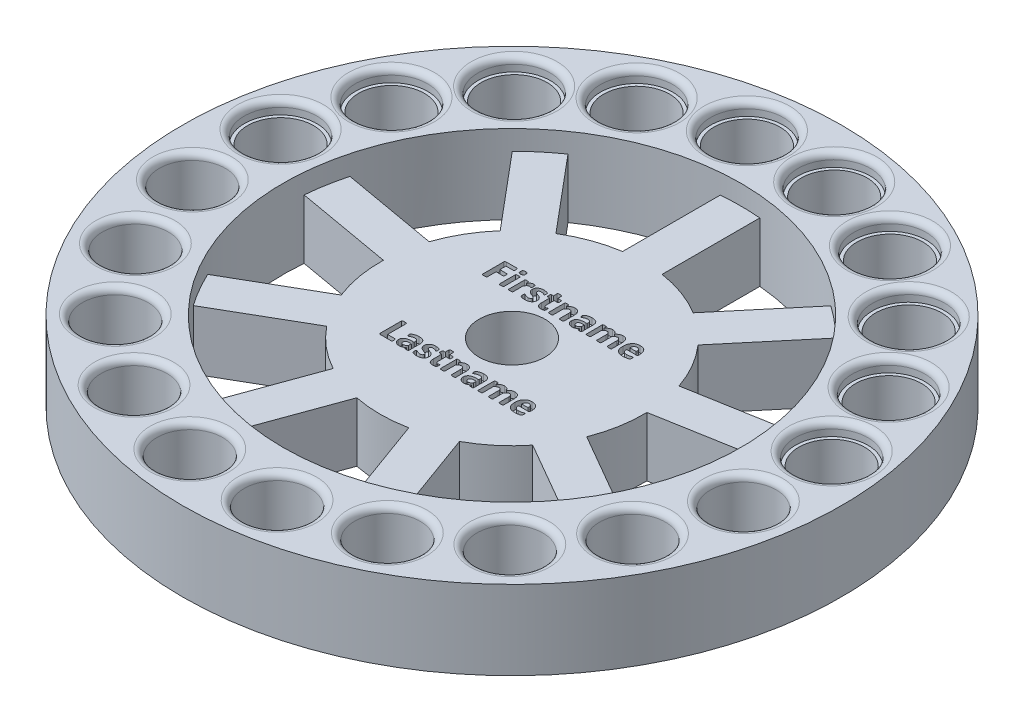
from build123d import *

# Parameters (mm, degrees)
SKETCH1_R           = 50
SKETCH1_R_2         = 34.727127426
BOSS_EXTRUDE1_DEPTH = 12
SKETCH1_4_R         = 20
BOSS_EXTRUDE2_DEPTH = 9
SKETCH7_R           = 5
CUT_EXTRUDE4_DEPTH  = 18
CUT_EXTRUDE5_DEPTH  = 1
SKETCH9_R           = 5
CUT_EXTRUDE7_DEPTH  = 10
SKETCH10_R          = 5.5
CUT_EXTRUDE8_DEPTH  = 2
FILLET1_R           = 1


with BuildPart() as part:
    # Sketch1 → Boss-Extrude1 (new body)
    with BuildSketch(Plane(origin=(0, 0, 0), x_dir=(1, 0, 0), z_dir=(0, 1, 0))):
        with Locations(Location((0, 0, 0), (0, 0, 270))):
            Circle(SKETCH1_R)
        with Locations(Location((0, 0, 0), (0, 0, 270))):
            Circle(SKETCH1_R_2, mode=Mode.SUBTRACT)
    extrude(amount=BOSS_EXTRUDE1_DEPTH)

    # Sketch1_4 → Boss-Extrude2 (add)
    with BuildSketch(Plane(origin=(0, 0, 0), x_dir=(1, 0, 0), z_dir=(0, 1, 0))):
        with BuildLine():
            ThreePointArc((-19.994257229, 0.479247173), (-19.69615506, 3.472963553), (-18.952368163, 6.388093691))
            Line((-18.952368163, 6.388093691), (-33.550747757, 8.962181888))
            ThreePointArc((-33.550747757, 8.962181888), (-34.199544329, 6.030302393), (-34.592636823, 3.05333537))
            Line((-34.592636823, 3.05333537), (-19.994257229, 0.479247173))
        make_face()
        with BuildLine():
            ThreePointArc((-15.0084355, 13.219185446), (-12.855752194, 15.320888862), (-10.412168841, 17.075911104))
            Line((-10.412168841, 17.075911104), (-19.940584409, 28.431434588))
            ThreePointArc((-19.940584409, 28.431434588), (-22.32216723, 26.60252299), (-24.536851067, 24.57470893))
            Line((-24.536851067, 24.57470893), (-15.0084355, 13.219185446))
        make_face()
        with BuildLine():
            ThreePointArc((-3, 19.773719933), (0, 20), (3, 19.773719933))
            Line((3, 19.773719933), (3, 34.597303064))
            ThreePointArc((3, 34.597303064), (0, 34.727127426), (-3, 34.597303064))
            Line((-3, 34.597303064), (-3, 19.773719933))
        make_face()
        with BuildLine():
            Line((19.940584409, 28.431434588), (10.412168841, 17.075911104))
            ThreePointArc((10.412168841, 17.075911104), (12.855752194, 15.320888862), (15.0084355, 13.219185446))
            Line((15.0084355, 13.219185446), (24.536851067, 24.57470893))
            ThreePointArc((24.536851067, 24.57470893), (22.32216723, 26.60252299), (19.940584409, 28.431434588))
        make_face()
        with BuildLine():
            Line((33.550747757, 8.962181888), (18.952368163, 6.388093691))
            ThreePointArc((18.952368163, 6.388093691), (19.69615506, 3.472963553), (19.994257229, 0.479247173))
            Line((19.994257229, 0.479247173), (34.592636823, 3.05333537))
            ThreePointArc((34.592636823, 3.05333537), (34.199544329, 6.030302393), (33.550747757, 8.962181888))
        make_face()
        with BuildLine():
            Line((31.462143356, -14.70057532), (18.62454379, -7.288783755))
            ThreePointArc((18.62454379, -7.288783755), (17.320508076, -10), (15.62454379, -12.484936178))
            Line((15.62454379, -12.484936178), (28.462143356, -19.896727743))
            ThreePointArc((28.462143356, -19.896727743), (30.074574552, -17.363563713), (31.462143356, -14.70057532))
        make_face()
        with BuildLine():
            Line((14.652052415, -31.484769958), (9.582088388, -17.555158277))
            ThreePointArc((9.582088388, -17.555158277), (6.840402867, -18.793852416), (3.943932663, -19.607279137))
            Line((3.943932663, -19.607279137), (9.01389669, -33.536890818))
            ThreePointArc((9.01389669, -33.536890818), (11.8773771, -32.632825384), (14.652052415, -31.484769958))
        make_face()
        with BuildLine():
            ThreePointArc((-3.943932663, -19.607279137), (-6.840402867, -18.793852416), (-9.582088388, -17.555158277))
            Line((-9.582088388, -17.555158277), (-14.652052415, -31.484769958))
            ThreePointArc((-14.652052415, -31.484769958), (-11.8773771, -32.632825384), (-9.01389669, -33.536890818))
            Line((-9.01389669, -33.536890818), (-3.943932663, -19.607279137))
        make_face()
        with BuildLine():
            ThreePointArc((-15.62454379, -12.484936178), (-17.320508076, -10), (-18.62454379, -7.288783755))
            Line((-18.62454379, -7.288783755), (-31.462143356, -14.70057532))
            ThreePointArc((-31.462143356, -14.70057532), (-30.074574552, -17.363563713), (-28.462143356, -19.896727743))
            Line((-28.462143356, -19.896727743), (-15.62454379, -12.484936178))
        make_face()
        Circle(SKETCH1_4_R)
    extrude(amount=BOSS_EXTRUDE2_DEPTH)

    # Sketch7 → Cut-Extrude4 (cut)
    with BuildSketch(Plane(origin=(0, 9, 0), x_dir=(1, 0, 0), z_dir=(0, 1, 0))):
        with Locations(Location((0, 0, 0), (0, 0, 270))):
            Circle(SKETCH7_R)
    extrude(amount=-CUT_EXTRUDE4_DEPTH, mode=Mode.SUBTRACT)

    # Sketch5 → Cut-Extrude5 (cut)
    # profile 1 of 18: a face of its own
    with BuildSketch(Plane(origin=(0, 9, 0), x_dir=(1, 0, 0), z_dir=(0, 1, 0))):
        with BuildLine():
            add(Edge.make_bspline(
                [(-8.693306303, 9.290555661), (-8.693419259, 9.266403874), (-8.69362673, 9.222043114), (-8.699769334, 9.161708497), (-8.706515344, 9.112220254), (-8.71937101, 9.074034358), (-8.735038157, 9.04493977), (-8.753197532, 9.024265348), (-8.774833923, 9.011527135), (-8.790200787, 9.009890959), (-8.797855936, 9.009075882)],
                knots=[0, 0, 0, 0, 1.774536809, 3.259377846, 4.458424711, 5.437111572, 6.204876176, 6.874511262, 7.439327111, 8, 8, 8, 8], degree=3))
            Line((-8.797855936, 9.009075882), (-9.928600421, 9.009075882))
            Line((-9.928600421, 9.009075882), (-9.928600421, 8.082605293))
            Line((-9.928600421, 8.082605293), (-8.867823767, 8.082605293))
            add(Edge.make_bspline(
                [(-8.867823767, 8.082605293), (-8.860168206, 8.082084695), (-8.844885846, 8.081045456), (-8.823782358, 8.069106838), (-8.804205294, 8.050738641), (-8.789537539, 8.021485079), (-8.776410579, 7.983549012), (-8.769762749, 7.933969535), (-8.763535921, 7.873133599), (-8.763367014, 7.828229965), (-8.763274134, 7.803538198)],
                knots=[0, 0, 0, 0, 0.558615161, 1.115131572, 1.743728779, 2.512966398, 3.493530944, 4.694878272, 6.182568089, 8, 8, 8, 8], degree=3))
            add(Edge.make_bspline(
                [(-8.763274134, 7.803538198), (-8.763365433, 7.778847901), (-8.763531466, 7.733946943), (-8.769802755, 7.672831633), (-8.77651544, 7.622528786), (-8.789722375, 7.582979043), (-8.804349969, 7.551998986), (-8.822973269, 7.530654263), (-8.845024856, 7.519052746), (-8.860200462, 7.517306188), (-8.867823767, 7.516428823)],
                knots=[0, 0, 0, 0, 1.78296615, 3.242443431, 4.44012452, 5.438855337, 6.244745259, 6.902941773, 7.448904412, 8, 8, 8, 8], degree=3))
            Line((-8.867823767, 7.516428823), (-9.928600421, 7.516428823))
            Line((-9.928600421, 7.516428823), (-9.928600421, 6.195886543))
            add(Edge.make_bspline(
                [(-9.928600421, 6.195886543), (-9.929250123, 6.18633565), (-9.930524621, 6.167599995), (-9.944777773, 6.141717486), (-9.969810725, 6.120155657), (-10.007187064, 6.104596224), (-10.056258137, 6.090869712), (-10.119467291, 6.081850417), (-10.198462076, 6.076692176), (-10.256714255, 6.075764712), (-10.288894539, 6.075252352)],
                knots=[0, 0, 0, 0, 0.55013651, 1.079183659, 1.663261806, 2.435963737, 3.406327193, 4.618925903, 6.132191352, 8, 8, 8, 8], degree=3))
            add(Edge.make_bspline(
                [(-10.288894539, 6.075252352), (-10.320529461, 6.075807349), (-10.378495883, 6.076824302), (-10.457321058, 6.081622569), (-10.520474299, 6.091338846), (-10.569911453, 6.103219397), (-10.60615844, 6.120051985), (-10.632494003, 6.1397837), (-10.646080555, 6.165892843), (-10.648147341, 6.184233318), (-10.649188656, 6.193473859)],
                knots=[0, 0, 0, 0, 1.847098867, 3.3845417, 4.604007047, 5.575716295, 6.338642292, 6.92769309, 7.459736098, 8, 8, 8, 8], degree=3))
            Line((-10.649188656, 6.193473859), (-10.649188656, 9.351676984))
            add(Edge.make_bspline(
                [(-10.649188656, 9.351676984), (-10.648428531, 9.369964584), (-10.646992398, 9.404516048), (-10.636235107, 9.452221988), (-10.617341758, 9.492230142), (-10.590058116, 9.523176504), (-10.557246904, 9.5465747), (-10.521006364, 9.563574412), (-10.481098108, 9.573591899), (-10.453551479, 9.574685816), (-10.439285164, 9.575252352)],
                knots=[0, 0, 0, 0, 1.259248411, 2.379146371, 3.345527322, 4.275026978, 5.187490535, 6.104614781, 7.018385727, 8, 8, 8, 8], degree=3))
            Line((-10.439285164, 9.575252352), (-8.798660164, 9.575252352))
            add(Edge.make_bspline(
                [(-8.798660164, 9.575252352), (-8.790718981, 9.574808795), (-8.775005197, 9.573931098), (-8.753523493, 9.561023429), (-8.735423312, 9.540553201), (-8.720224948, 9.511012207), (-8.707410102, 9.471779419), (-8.699524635, 9.421359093), (-8.693724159, 9.35985598), (-8.693453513, 9.314970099), (-8.693306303, 9.290555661)],
                knots=[0, 0, 0, 0, 0.569518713, 1.126947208, 1.760336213, 2.53509976, 3.519422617, 4.744431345, 6.229223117, 8, 8, 8, 8], degree=3))
        make_face()
    # profile 2 of 18: a face of its own
    with BuildSketch(Plane(origin=(0, 9, 0), x_dir=(1, 0, 0), z_dir=(0, 1, 0))):
        with BuildLine():
            add(Edge.make_bspline(
                [(-7.406541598, 6.183018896), (-7.407327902, 6.174578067), (-7.408909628, 6.157598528), (-7.421882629, 6.133558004), (-7.445887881, 6.114462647), (-7.479880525, 6.099567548), (-7.5256838, 6.089091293), (-7.583962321, 6.080139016), (-7.657408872, 6.076050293), (-7.711343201, 6.075536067), (-7.741100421, 6.075252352)],
                knots=[0, 0, 0, 0, 0.529265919, 1.064669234, 1.662496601, 2.424160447, 3.380761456, 4.608421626, 6.128762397, 8, 8, 8, 8], degree=3))
            add(Edge.make_bspline(
                [(-7.741100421, 6.075252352), (-7.770853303, 6.075561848), (-7.825047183, 6.076125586), (-7.898544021, 6.079947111), (-7.956974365, 6.089384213), (-8.002735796, 6.099193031), (-8.036471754, 6.114695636), (-8.060325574, 6.133541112), (-8.073289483, 6.157602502), (-8.074872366, 6.174579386), (-8.075659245, 6.183018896)],
                knots=[0, 0, 0, 0, 1.870946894, 3.407867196, 4.618679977, 5.591473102, 6.337761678, 6.935496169, 7.470816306, 8, 8, 8, 8], degree=3))
            Line((-8.075659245, 6.183018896), (-8.075659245, 8.586856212))
            add(Edge.make_bspline(
                [(-8.075659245, 8.586856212), (-8.074957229, 8.595595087), (-8.073585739, 8.612667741), (-8.060038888, 8.636443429), (-8.036357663, 8.655195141), (-8.002629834, 8.671272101), (-7.957354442, 8.684482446), (-7.898483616, 8.693540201), (-7.825152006, 8.700068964), (-7.770875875, 8.700187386), (-7.741100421, 8.700252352)],
                knots=[0, 0, 0, 0, 0.543924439, 1.062634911, 1.658284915, 2.409329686, 3.392165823, 4.601441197, 6.135577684, 8, 8, 8, 8], degree=3))
            add(Edge.make_bspline(
                [(-7.741100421, 8.700252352), (-7.711319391, 8.70021785), (-7.657300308, 8.700155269), (-7.584031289, 8.693323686), (-7.525282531, 8.684811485), (-7.480010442, 8.670866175), (-7.445994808, 8.65543209), (-7.422169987, 8.636426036), (-7.408613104, 8.612672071), (-7.407242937, 8.595596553), (-7.406541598, 8.586856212)],
                knots=[0, 0, 0, 0, 1.864694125, 3.382323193, 4.6083395, 5.57525916, 6.341473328, 6.93721017, 7.455996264, 8, 8, 8, 8], degree=3))
            Line((-7.406541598, 8.586856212), (-7.406541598, 6.183018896))
        make_face()
    # profile 3 of 18: a face of its own
    with BuildSketch(Plane(origin=(0, 9, 0), x_dir=(1, 0, 0), z_dir=(0, 1, 0))):
        with BuildLine():
            add(Edge.make_bspline(
                [(-7.355071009, 9.426470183), (-7.355634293, 9.39446936), (-7.356675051, 9.335342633), (-7.373016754, 9.254496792), (-7.397379, 9.1882369), (-7.435774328, 9.136631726), (-7.48982643, 9.100304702), (-7.559747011, 9.077661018), (-7.645806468, 9.062327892), (-7.709114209, 9.061173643), (-7.743513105, 9.06054647)],
                knots=[0, 0, 0, 0, 1.220507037, 2.255085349, 3.137679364, 3.897760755, 4.670641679, 5.584311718, 6.687411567, 8, 8, 8, 8], degree=3))
            add(Edge.make_bspline(
                [(-7.743513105, 9.06054647), (-7.778158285, 9.061283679), (-7.841912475, 9.062640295), (-7.928371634, 9.076624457), (-7.997825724, 9.09879996), (-8.051146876, 9.133661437), (-8.086506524, 9.184423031), (-8.111391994, 9.247254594), (-8.124783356, 9.32539902), (-8.126308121, 9.382191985), (-8.127129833, 9.412798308)],
                knots=[0, 0, 0, 0, 1.351650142, 2.487311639, 3.407538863, 4.182702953, 4.923764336, 5.782854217, 6.805156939, 8, 8, 8, 8], degree=3))
            add(Edge.make_bspline(
                [(-8.127129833, 9.412798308), (-8.126397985, 9.444756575), (-8.125040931, 9.504016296), (-8.110629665, 9.585319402), (-8.084987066, 9.651007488), (-8.048221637, 9.703642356), (-7.994014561, 9.740491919), (-7.924006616, 9.76438604), (-7.837152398, 9.779232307), (-7.77333981, 9.780465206), (-7.738687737, 9.781134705)],
                knots=[0, 0, 0, 0, 1.215895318, 2.254615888, 3.12440848, 3.883677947, 4.659499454, 5.5731999, 6.682177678, 8, 8, 8, 8], degree=3))
            add(Edge.make_bspline(
                [(-7.738687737, 9.781134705), (-7.704324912, 9.780362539), (-7.641394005, 9.778948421), (-7.555384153, 9.765409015), (-7.486953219, 9.741060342), (-7.433593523, 9.706009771), (-7.395947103, 9.656065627), (-7.372270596, 9.592258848), (-7.356878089, 9.514321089), (-7.355707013, 9.457389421), (-7.355071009, 9.426470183)],
                knots=[0, 0, 0, 0, 1.341111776, 2.456066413, 3.383351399, 4.158467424, 4.912088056, 5.78082444, 6.794779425, 8, 8, 8, 8], degree=3))
        make_face()
    # profile 4 of 18: a face of its own
    with BuildSketch(Plane(origin=(0, 9, 0), x_dir=(1, 0, 0), z_dir=(0, 1, 0))):
        with BuildLine():
            add(Edge.make_bspline(
                [(-5.141835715, 8.384994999), (-5.14218935, 8.356577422), (-5.142830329, 8.30506925), (-5.146115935, 8.235726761), (-5.153371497, 8.181138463), (-5.162472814, 8.139726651), (-5.174068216, 8.108695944), (-5.190717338, 8.087445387), (-5.213048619, 8.075875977), (-5.229098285, 8.075015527), (-5.23753884, 8.074563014)],
                knots=[0, 0, 0, 0, 1.923926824, 3.487206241, 4.695994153, 5.646766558, 6.354500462, 6.92143159, 7.432778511, 8, 8, 8, 8], degree=3))
            add(Edge.make_bspline(
                [(-5.23753884, 8.074563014), (-5.245368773, 8.075061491), (-5.262126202, 8.076128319), (-5.287843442, 8.084600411), (-5.316571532, 8.094239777), (-5.348649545, 8.104778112), (-5.384202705, 8.115407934), (-5.423275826, 8.124994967), (-5.466435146, 8.133029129), (-5.49672575, 8.133716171), (-5.512584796, 8.134075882)],
                knots=[0, 0, 0, 0, 0.663425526, 1.419847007, 2.283350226, 3.240426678, 4.284446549, 5.432406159, 6.655702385, 8, 8, 8, 8], degree=3))
            add(Edge.make_bspline(
                [(-5.512584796, 8.134075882), (-5.531764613, 8.132744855), (-5.570978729, 8.130023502), (-5.629187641, 8.109896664), (-5.6885853, 8.078255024), (-5.749807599, 8.032485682), (-5.812937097, 7.970917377), (-5.878168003, 7.89228958), (-5.947640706, 7.795756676), (-5.992635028, 7.723419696), (-6.016835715, 7.684512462)],
                knots=[0, 0, 0, 0, 0.654435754, 1.338027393, 2.083720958, 2.948403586, 3.939529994, 5.090016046, 6.434833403, 8, 8, 8, 8], degree=3))
            Line((-6.016835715, 7.684512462), (-6.016835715, 6.183018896))
            add(Edge.make_bspline(
                [(-6.016835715, 6.183018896), (-6.017622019, 6.174578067), (-6.019203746, 6.157598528), (-6.032176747, 6.133558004), (-6.056181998, 6.114462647), (-6.090174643, 6.099567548), (-6.135977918, 6.089091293), (-6.194256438, 6.080139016), (-6.26770299, 6.076050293), (-6.321637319, 6.075536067), (-6.351394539, 6.075252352)],
                knots=[0, 0, 0, 0, 0.529265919, 1.064669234, 1.662496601, 2.424160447, 3.380761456, 4.608421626, 6.128762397, 8, 8, 8, 8], degree=3))
            add(Edge.make_bspline(
                [(-6.351394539, 6.075252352), (-6.381147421, 6.075561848), (-6.4353413, 6.076125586), (-6.508838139, 6.079947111), (-6.567268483, 6.089384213), (-6.613029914, 6.099193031), (-6.646765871, 6.114695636), (-6.670619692, 6.133541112), (-6.6835836, 6.157602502), (-6.685166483, 6.174579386), (-6.685953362, 6.183018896)],
                knots=[0, 0, 0, 0, 1.870946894, 3.407867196, 4.618679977, 5.591473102, 6.337761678, 6.935496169, 7.470816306, 8, 8, 8, 8], degree=3))
            Line((-6.685953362, 6.183018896), (-6.685953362, 8.592485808))
            add(Edge.make_bspline(
                [(-6.685953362, 8.592485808), (-6.685371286, 8.600889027), (-6.684238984, 8.61723563), (-6.673802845, 8.641064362), (-6.653314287, 8.660907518), (-6.622272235, 8.674654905), (-6.582936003, 8.686770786), (-6.532259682, 8.693919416), (-6.470030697, 8.699932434), (-6.424066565, 8.700139), (-6.398843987, 8.700252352)],
                knots=[0, 0, 0, 0, 0.596235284, 1.159843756, 1.807279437, 2.575043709, 3.552545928, 4.731668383, 6.20652006, 8, 8, 8, 8], degree=3))
            add(Edge.make_bspline(
                [(-6.398843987, 8.700252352), (-6.37307917, 8.700161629), (-6.326300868, 8.699996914), (-6.263068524, 8.693781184), (-6.212434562, 8.687243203), (-6.174627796, 8.674670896), (-6.145398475, 8.661030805), (-6.128204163, 8.640041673), (-6.11636294, 8.617531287), (-6.11542856, 8.600950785), (-6.114951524, 8.592485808)],
                knots=[0, 0, 0, 0, 1.84556318, 3.350783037, 4.557851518, 5.487811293, 6.21030578, 6.823254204, 7.39922654, 8, 8, 8, 8], degree=3))
            Line((-6.114951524, 8.592485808), (-6.114951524, 8.292508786))
            add(Edge.make_bspline(
                [(-6.114951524, 8.292508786), (-6.099560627, 8.314337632), (-6.06973923, 8.356633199), (-6.024081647, 8.415886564), (-5.979678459, 8.469152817), (-5.924761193, 8.530601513), (-5.858575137, 8.595299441), (-5.779812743, 8.658132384), (-5.702569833, 8.703967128), (-5.624906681, 8.732261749), (-5.54792447, 8.749193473), (-5.4963154, 8.750885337), (-5.470764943, 8.75172294)],
                knots=[0, 0, 0, 0, 0.97102092, 1.881449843, 2.718826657, 3.491842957, 4.877299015, 6.078375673, 7.148309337, 8.12596046, 9.072206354, 10, 10, 10, 10], degree=3))
            add(Edge.make_bspline(
                [(-5.470764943, 8.75172294), (-5.458426, 8.751620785), (-5.433170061, 8.751411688), (-5.393989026, 8.747838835), (-5.352884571, 8.742451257), (-5.311105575, 8.734276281), (-5.271115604, 8.725494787), (-5.236475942, 8.713942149), (-5.207827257, 8.703927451), (-5.18749179, 8.690552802), (-5.173623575, 8.67607233), (-5.164308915, 8.659693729), (-5.157833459, 8.639707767), (-5.152225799, 8.613871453), (-5.147182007, 8.578166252), (-5.14472423, 8.529241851), (-5.14198592, 8.463303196), (-5.141890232, 8.413416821), (-5.141835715, 8.384994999)],
                knots=[0, 0, 0, 0, 0.974109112, 1.993853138, 3.104689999, 4.246566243, 5.355787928, 6.333341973, 7.131417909, 7.74209108, 8.236339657, 8.701144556, 9.216698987, 9.889532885, 10.787754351, 12.060851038, 13.755744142, 16, 16, 16, 16], degree=3))
        make_face()
    # profile 5 of 18: a face of its own
    with BuildSketch(Plane(origin=(0, 9, 0), x_dir=(1, 0, 0), z_dir=(0, 1, 0))):
        with BuildLine():
            add(Edge.make_bspline(
                [(-3.031541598, 6.861787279), (-3.03245007, 6.828498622), (-3.034224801, 6.763468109), (-3.048587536, 6.668844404), (-3.073993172, 6.580545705), (-3.107611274, 6.4980659), (-3.15033047, 6.422144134), (-3.201810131, 6.353091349), (-3.260702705, 6.290034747), (-3.327618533, 6.233532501), (-3.402449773, 6.18479067), (-3.482781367, 6.140877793), (-3.570332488, 6.104928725), (-3.66371728, 6.075343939), (-3.762099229, 6.0520284), (-3.86515841, 6.036501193), (-3.971973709, 6.025268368), (-4.044837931, 6.024282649), (-4.081863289, 6.023781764)],
                knots=[0, 0, 0, 0, 1.053920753, 2.058869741, 3.020913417, 3.957370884, 4.873482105, 5.771678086, 6.678617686, 7.600375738, 8.537487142, 9.502298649, 10.495561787, 11.529217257, 12.602047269, 13.693491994, 14.827966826, 16, 16, 16, 16], degree=3))
            add(Edge.make_bspline(
                [(-4.081863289, 6.023781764), (-4.126133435, 6.024718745), (-4.213012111, 6.02655754), (-4.339019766, 6.040546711), (-4.455500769, 6.061219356), (-4.559741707, 6.086595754), (-4.649069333, 6.115165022), (-4.722667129, 6.144402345), (-4.778452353, 6.173322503), (-4.823507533, 6.200204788), (-4.852368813, 6.24216736), (-4.867743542, 6.286291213), (-4.876602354, 6.331538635), (-4.880929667, 6.375416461), (-4.884356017, 6.426646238), (-4.884438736, 6.463418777), (-4.884482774, 6.482995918)],
                knots=[0, 0, 0, 0, 1.746246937, 3.42695102, 4.995388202, 6.411352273, 7.655588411, 8.694547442, 9.527059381, 10.143124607, 10.733317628, 11.489654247, 11.975014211, 12.549650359, 13.227855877, 14, 14, 14, 14], degree=3))
            add(Edge.make_bspline(
                [(-4.884482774, 6.482995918), (-4.884129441, 6.507655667), (-4.883498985, 6.551656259), (-4.880301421, 6.61089781), (-4.872543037, 6.656708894), (-4.864848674, 6.692475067), (-4.852422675, 6.718057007), (-4.83634567, 6.735020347), (-4.81657049, 6.743300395), (-4.802519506, 6.744004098), (-4.795213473, 6.744369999)],
                knots=[0, 0, 0, 0, 1.948138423, 3.476079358, 4.676835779, 5.616477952, 6.355019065, 6.893929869, 7.424881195, 8, 8, 8, 8], degree=3))
            add(Edge.make_bspline(
                [(-4.795213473, 6.744369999), (-4.78240826, 6.742301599), (-4.751008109, 6.737229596), (-4.701772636, 6.708570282), (-4.63664121, 6.677247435), (-4.557759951, 6.639150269), (-4.463383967, 6.604126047), (-4.355792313, 6.568080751), (-4.231816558, 6.54208306), (-4.143394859, 6.539722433), (-4.09714362, 6.538487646)],
                knots=[0, 0, 0, 0, 0.420522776, 1.031179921, 1.833497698, 2.788844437, 3.885880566, 5.117467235, 6.49221726, 8, 8, 8, 8], degree=3))
            add(Edge.make_bspline(
                [(-4.09714362, 6.538487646), (-4.067874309, 6.539426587), (-4.01277488, 6.541194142), (-3.934763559, 6.553894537), (-3.867073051, 6.575486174), (-3.808407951, 6.604211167), (-3.760621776, 6.642097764), (-3.725537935, 6.689661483), (-3.703583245, 6.745809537), (-3.701653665, 6.786255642), (-3.700659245, 6.807099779)],
                knots=[0, 0, 0, 0, 1.305388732, 2.457392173, 3.512472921, 4.464388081, 5.357078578, 6.20373117, 7.074282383, 8, 8, 8, 8], degree=3))
            add(Edge.make_bspline(
                [(-3.700659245, 6.807099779), (-3.701214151, 6.820309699), (-3.702294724, 6.846033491), (-3.712549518, 6.882656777), (-3.727815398, 6.9168935), (-3.759470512, 6.957915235), (-3.810881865, 7.005264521), (-3.888273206, 7.05121316), (-3.978155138, 7.092456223), (-4.078133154, 7.130530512), (-4.184560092, 7.169686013), (-4.29343241, 7.213639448), (-4.40286936, 7.262411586), (-4.510479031, 7.317031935), (-4.610874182, 7.384250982), (-4.687396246, 7.449806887), (-4.73967804, 7.511489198), (-4.776468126, 7.561148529), (-4.807424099, 7.616326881), (-4.835227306, 7.675477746), (-4.858228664, 7.73987764), (-4.872786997, 7.810800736), (-4.882866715, 7.887156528), (-4.88393273, 7.940220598), (-4.884482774, 7.967600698)],
                knots=[0, 0, 0, 0, 0.485752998, 0.94591096, 1.392394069, 1.858768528, 2.844489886, 3.949423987, 5.160536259, 6.487096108, 7.890990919, 9.340458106, 10.813177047, 12.306924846, 13.781233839, 15.258189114, 16.000868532, 16.757804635, 17.532334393, 18.328002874, 19.16545565, 20.045316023, 20.991418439, 22, 22, 22, 22], degree=3))
            add(Edge.make_bspline(
                [(-4.884482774, 7.967600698), (-4.883827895, 7.996073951), (-4.882541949, 8.051985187), (-4.868885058, 8.133861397), (-4.848457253, 8.21230096), (-4.818288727, 8.286655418), (-4.780356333, 8.356644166), (-4.735392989, 8.42245288), (-4.681772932, 8.481704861), (-4.621911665, 8.536560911), (-4.553709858, 8.58418742), (-4.479737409, 8.628333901), (-4.397940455, 8.664778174), (-4.309910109, 8.696494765), (-4.215419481, 8.721151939), (-4.114795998, 8.738516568), (-4.008962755, 8.750405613), (-3.936332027, 8.75127812), (-3.899303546, 8.75172294)],
                knots=[0, 0, 0, 0, 0.964875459, 1.894668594, 2.807773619, 3.70939832, 4.608497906, 5.503865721, 6.405444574, 7.313100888, 8.251699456, 9.221659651, 10.230762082, 11.283372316, 12.39269323, 13.53776939, 14.744709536, 16, 16, 16, 16], degree=3))
            add(Edge.make_bspline(
                [(-3.899303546, 8.75172294), (-3.86199968, 8.751320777), (-3.788286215, 8.750526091), (-3.680570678, 8.737810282), (-3.579191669, 8.723801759), (-3.487583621, 8.703985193), (-3.407627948, 8.683625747), (-3.342132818, 8.658943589), (-3.291372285, 8.637508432), (-3.254961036, 8.617896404), (-3.231257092, 8.598289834), (-3.215931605, 8.577963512), (-3.205785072, 8.555344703), (-3.199070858, 8.529466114), (-3.193045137, 8.498336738), (-3.18974193, 8.460630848), (-3.185923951, 8.414822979), (-3.185942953, 8.381522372), (-3.185953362, 8.363280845)],
                knots=[0, 0, 0, 0, 1.907793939, 3.769853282, 5.545184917, 7.143486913, 8.564560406, 9.762481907, 10.720881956, 11.384540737, 11.871146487, 12.282730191, 12.675595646, 13.131651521, 13.648276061, 14.296729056, 15.066976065, 16, 16, 16, 16], degree=3))
            add(Edge.make_bspline(
                [(-3.185953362, 8.363280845), (-3.185999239, 8.341829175), (-3.186081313, 8.303451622), (-3.189063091, 8.251874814), (-3.194422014, 8.21141645), (-3.202149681, 8.180521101), (-3.212020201, 8.15696333), (-3.22734339, 8.142023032), (-3.246069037, 8.135495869), (-3.258829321, 8.134566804), (-3.265571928, 8.134075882)],
                knots=[0, 0, 0, 0, 1.914589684, 3.425247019, 4.609746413, 5.550065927, 6.267182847, 6.859674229, 7.397445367, 8, 8, 8, 8], degree=3))
            add(Edge.make_bspline(
                [(-3.265571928, 8.134075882), (-3.275583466, 8.135906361), (-3.301261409, 8.14060124), (-3.344014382, 8.160131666), (-3.399310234, 8.186328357), (-3.468394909, 8.213102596), (-3.549647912, 8.240770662), (-3.643411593, 8.265544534), (-3.750267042, 8.285495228), (-3.826280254, 8.287455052), (-3.866330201, 8.288487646)],
                knots=[0, 0, 0, 0, 0.38958176, 0.999212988, 1.791318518, 2.743038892, 3.83978811, 5.085433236, 6.464369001, 8, 8, 8, 8], degree=3))
            add(Edge.make_bspline(
                [(-3.866330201, 8.288487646), (-3.894328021, 8.287898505), (-3.947104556, 8.28678796), (-4.019817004, 8.269885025), (-4.082097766, 8.246797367), (-4.131401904, 8.212039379), (-4.169688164, 8.169991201), (-4.196189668, 8.121345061), (-4.211914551, 8.067734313), (-4.214200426, 8.030701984), (-4.215365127, 8.011833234)],
                knots=[0, 0, 0, 0, 1.332111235, 2.511060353, 3.544002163, 4.480550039, 5.358800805, 6.234441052, 7.100410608, 8, 8, 8, 8], degree=3))
            add(Edge.make_bspline(
                [(-4.215365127, 8.011833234), (-4.214811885, 7.998355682), (-4.213734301, 7.972104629), (-4.203453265, 7.934702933), (-4.188407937, 7.899817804), (-4.156789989, 7.858556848), (-4.104026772, 7.813512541), (-4.02754871, 7.767400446), (-3.937628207, 7.72676879), (-3.838068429, 7.686985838), (-3.731004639, 7.64976347), (-3.622658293, 7.605980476), (-3.513853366, 7.558304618), (-3.406971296, 7.503464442), (-3.304678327, 7.438965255), (-3.214826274, 7.35743153), (-3.137029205, 7.261508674), (-3.089116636, 7.167321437), (-3.058625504, 7.084408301), (-3.043153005, 7.015192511), (-3.033158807, 6.940358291), (-3.032094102, 6.888630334), (-3.031541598, 6.861787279)],
                knots=[0, 0, 0, 0, 0.452710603, 0.881772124, 1.297821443, 1.723834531, 2.618758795, 3.615644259, 4.721943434, 5.937021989, 7.224744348, 8.537029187, 9.870373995, 11.222675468, 12.57948713, 13.927897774, 15.289503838, 16.714513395, 17.462477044, 18.25937234, 19.096740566, 20, 20, 20, 20], degree=3))
        make_face()
    # profile 6 of 18: a face of its own
    with BuildSketch(Plane(origin=(0, 9, 0), x_dir=(1, 0, 0), z_dir=(0, 1, 0))):
        with BuildLine():
            add(Edge.make_bspline(
                [(-1.127129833, 6.404985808), (-1.127294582, 6.386488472), (-1.127605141, 6.351620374), (-1.129585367, 6.302722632), (-1.134507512, 6.260590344), (-1.142202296, 6.216613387), (-1.154949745, 6.174042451), (-1.177128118, 6.133601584), (-1.212080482, 6.10910633), (-1.252509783, 6.087685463), (-1.303239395, 6.069967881), (-1.360759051, 6.052977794), (-1.425719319, 6.0405704), (-1.495232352, 6.0310111), (-1.568032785, 6.025563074), (-1.617165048, 6.024377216), (-1.641835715, 6.023781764)],
                knots=[0, 0, 0, 0, 1.018499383, 1.919905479, 2.692481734, 3.352538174, 4.374773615, 5.136702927, 5.830547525, 6.682250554, 7.658264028, 8.779388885, 9.983517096, 11.294356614, 12.641421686, 14, 14, 14, 14], degree=3))
            add(Edge.make_bspline(
                [(-1.641835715, 6.023781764), (-1.673762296, 6.024368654), (-1.735892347, 6.025510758), (-1.825735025, 6.035182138), (-1.909243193, 6.051040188), (-1.985957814, 6.073699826), (-2.056930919, 6.101868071), (-2.119701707, 6.140382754), (-2.178845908, 6.182052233), (-2.229181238, 6.234050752), (-2.27513546, 6.290990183), (-2.312440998, 6.356363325), (-2.34508065, 6.427493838), (-2.370700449, 6.506050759), (-2.389440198, 6.592093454), (-2.404234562, 6.685221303), (-2.411717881, 6.786069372), (-2.413153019, 6.85561186), (-2.413894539, 6.891543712)],
                knots=[0, 0, 0, 0, 1.143209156, 2.224718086, 3.232130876, 4.183055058, 5.08706435, 5.95650602, 6.814903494, 7.670342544, 8.538564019, 9.429424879, 10.35753592, 11.33824033, 12.381747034, 13.508835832, 14.712842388, 16, 16, 16, 16], degree=3))
            Line((-2.413894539, 6.891543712), (-2.413894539, 8.134075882))
            Line((-2.413894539, 8.134075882), (-2.715480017, 8.134075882))
            add(Edge.make_bspline(
                [(-2.715480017, 8.134075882), (-2.723919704, 8.134860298), (-2.740896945, 8.136438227), (-2.764771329, 8.149341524), (-2.782920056, 8.171915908), (-2.799858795, 8.200820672), (-2.811156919, 8.240206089), (-2.819602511, 8.289508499), (-2.825147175, 8.349761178), (-2.825479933, 8.39356163), (-2.825659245, 8.417164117)],
                knots=[0, 0, 0, 0, 0.608454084, 1.223963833, 1.896604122, 2.677721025, 3.63370286, 4.834772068, 6.29437262, 8, 8, 8, 8], degree=3))
            add(Edge.make_bspline(
                [(-2.825659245, 8.417164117), (-2.825497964, 8.441842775), (-2.825201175, 8.487256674), (-2.819569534, 8.549339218), (-2.811451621, 8.599337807), (-2.799671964, 8.638190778), (-2.783571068, 8.666848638), (-2.76333268, 8.686419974), (-2.739557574, 8.699064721), (-2.722072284, 8.699848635), (-2.713067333, 8.700252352)],
                knots=[0, 0, 0, 0, 1.761495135, 3.241519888, 4.446868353, 5.37304053, 6.12812549, 6.764440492, 7.363684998, 8, 8, 8, 8], degree=3))
            Line((-2.713067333, 8.700252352), (-2.413894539, 8.700252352))
            Line((-2.413894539, 8.700252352), (-2.413894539, 9.252756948))
            add(Edge.make_bspline(
                [(-2.413894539, 9.252756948), (-2.413029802, 9.26169462), (-2.411341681, 9.279142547), (-2.400194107, 9.304806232), (-2.377556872, 9.326255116), (-2.343284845, 9.343119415), (-2.296817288, 9.355061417), (-2.23721269, 9.363314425), (-2.163882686, 9.368911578), (-2.11017682, 9.369208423), (-2.080944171, 9.369369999)],
                knots=[0, 0, 0, 0, 0.555792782, 1.085006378, 1.697298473, 2.449599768, 3.435457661, 4.664787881, 6.184610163, 8, 8, 8, 8], degree=3))
            add(Edge.make_bspline(
                [(-2.080944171, 9.369369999), (-2.050636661, 9.369235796), (-1.995853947, 9.368993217), (-1.921737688, 9.36331961), (-1.862851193, 9.355253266), (-1.817358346, 9.342842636), (-1.783344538, 9.32608281), (-1.760459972, 9.304649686), (-1.746948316, 9.279560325), (-1.745505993, 9.261756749), (-1.744776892, 9.252756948)],
                knots=[0, 0, 0, 0, 1.871583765, 3.383004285, 4.589165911, 5.537728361, 6.285870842, 6.906598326, 7.447279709, 8, 8, 8, 8], degree=3))
            Line((-1.744776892, 9.252756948), (-1.744776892, 8.700252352))
            Line((-1.744776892, 8.700252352), (-1.232483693, 8.700252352))
            add(Edge.make_bspline(
                [(-1.232483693, 8.700252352), (-1.223989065, 8.699862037), (-1.207469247, 8.699102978), (-1.185319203, 8.686059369), (-1.165835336, 8.666984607), (-1.151974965, 8.637655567), (-1.13937274, 8.599521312), (-1.132626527, 8.549234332), (-1.12778167, 8.487239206), (-1.12735941, 8.441844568), (-1.127129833, 8.417164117)],
                knots=[0, 0, 0, 0, 0.606601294, 1.179680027, 1.810926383, 2.557524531, 3.496505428, 4.715283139, 6.214143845, 8, 8, 8, 8], degree=3))
            add(Edge.make_bspline(
                [(-1.127129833, 8.417164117), (-1.127431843, 8.393571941), (-1.127992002, 8.349813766), (-1.132098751, 8.289463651), (-1.141017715, 8.240293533), (-1.151576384, 8.201205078), (-1.166534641, 8.171761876), (-1.183892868, 8.149748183), (-1.206129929, 8.136420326), (-1.222143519, 8.134852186), (-1.230071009, 8.134075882)],
                knots=[0, 0, 0, 0, 1.729548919, 3.207923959, 4.425838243, 5.389435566, 6.162763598, 6.831980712, 7.421774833, 8, 8, 8, 8], degree=3))
            Line((-1.230071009, 8.134075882), (-1.744776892, 8.134075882))
            Line((-1.744776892, 8.134075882), (-1.744776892, 6.988855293))
            add(Edge.make_bspline(
                [(-1.744776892, 6.988855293), (-1.744043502, 6.957720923), (-1.742666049, 6.899244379), (-1.731714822, 6.817713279), (-1.713738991, 6.748101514), (-1.68771916, 6.690024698), (-1.649989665, 6.643435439), (-1.599004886, 6.611908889), (-1.536697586, 6.592977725), (-1.491596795, 6.591014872), (-1.467318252, 6.589958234)],
                knots=[0, 0, 0, 0, 1.338302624, 2.513598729, 3.528575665, 4.42058712, 5.230802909, 6.065332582, 6.958534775, 8, 8, 8, 8], degree=3))
            add(Edge.make_bspline(
                [(-1.467318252, 6.589958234), (-1.450679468, 6.590441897), (-1.41914258, 6.591358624), (-1.374037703, 6.597649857), (-1.334389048, 6.608726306), (-1.298757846, 6.619436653), (-1.269013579, 6.632020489), (-1.243351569, 6.641682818), (-1.221760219, 6.650253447), (-1.207616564, 6.651370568), (-1.201118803, 6.651883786)],
                knots=[0, 0, 0, 0, 1.451015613, 2.750232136, 3.957898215, 5.037257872, 5.992252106, 6.769310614, 7.434606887, 8, 8, 8, 8], degree=3))
            add(Edge.make_bspline(
                [(-1.201118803, 6.651883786), (-1.195672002, 6.651427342), (-1.184805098, 6.650516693), (-1.169258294, 6.642523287), (-1.154939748, 6.627364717), (-1.147009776, 6.601824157), (-1.13865312, 6.568393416), (-1.132835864, 6.524395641), (-1.127616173, 6.468913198), (-1.127303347, 6.427793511), (-1.127129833, 6.404985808)],
                knots=[0, 0, 0, 0, 0.4674882, 0.932684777, 1.472328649, 2.219223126, 3.194753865, 4.456631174, 6.034612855, 8, 8, 8, 8], degree=3))
        make_face()
    # profile 7 of 18: a face of its own
    with BuildSketch(Plane(origin=(0, 9, 0), x_dir=(1, 0, 0), z_dir=(0, 1, 0))):
        with BuildLine():
            add(Edge.make_bspline(
                [(1.70375252, 6.183823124), (1.703002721, 6.175107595), (1.701517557, 6.157844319), (1.68841699, 6.133542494), (1.664567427, 6.114687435), (1.631056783, 6.099346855), (1.585385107, 6.08915558), (1.527146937, 6.080115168), (1.453953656, 6.076073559), (1.400289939, 6.075543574), (1.370802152, 6.075252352)],
                knots=[0, 0, 0, 0, 0.546970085, 1.083410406, 1.682395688, 2.430245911, 3.388699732, 4.618737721, 6.142023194, 8, 8, 8, 8], degree=3))
            add(Edge.make_bspline(
                [(1.370802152, 6.075252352), (1.340781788, 6.075562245), (1.28605339, 6.076127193), (1.211749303, 6.079954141), (1.152796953, 6.089365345), (1.106924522, 6.098978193), (1.073625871, 6.114901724), (1.050259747, 6.133433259), (1.036845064, 6.156967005), (1.035375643, 6.173752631), (1.034634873, 6.182214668)],
                knots=[0, 0, 0, 0, 1.883008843, 3.432804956, 4.657161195, 5.627487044, 6.356734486, 6.952952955, 7.472158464, 8, 8, 8, 8], degree=3))
            Line((1.034634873, 6.182214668), (1.034634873, 7.542968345))
            add(Edge.make_bspline(
                [(1.034634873, 7.542968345), (1.034327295, 7.57031576), (1.033744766, 7.622109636), (1.029446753, 7.695228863), (1.020433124, 7.758826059), (1.006214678, 7.829579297), (0.979496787, 7.906315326), (0.934255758, 7.985930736), (0.875574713, 8.051881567), (0.813699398, 8.091260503), (0.75883127, 8.113266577), (0.71353345, 8.125631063), (0.664916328, 8.132710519), (0.631203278, 8.133614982), (0.61402366, 8.134075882)],
                knots=[0, 0, 0, 0, 1.192023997, 2.257600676, 3.189562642, 3.989316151, 5.400937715, 6.70962743, 7.958532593, 9.20956755, 9.864824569, 10.530930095, 11.251386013, 12, 12, 12, 12], degree=3))
            add(Edge.make_bspline(
                [(0.61402366, 8.134075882), (0.591390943, 8.133027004), (0.545442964, 8.130897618), (0.476782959, 8.111837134), (0.408260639, 8.081698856), (0.339358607, 8.039952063), (0.270622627, 7.986785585), (0.198966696, 7.924934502), (0.128173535, 7.850109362), (0.081157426, 7.796201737), (0.056693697, 7.768152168)],
                knots=[0, 0, 0, 0, 0.789110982, 1.602019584, 2.469887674, 3.397880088, 4.407081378, 5.501763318, 6.700101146, 8, 8, 8, 8], degree=3))
            Line((0.056693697, 7.768152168), (0.056693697, 6.182214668))
            add(Edge.make_bspline(
                [(0.056693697, 6.182214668), (0.055954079, 6.173750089), (0.054486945, 6.156959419), (0.041054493, 6.133464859), (0.017388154, 6.114442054), (-0.016660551, 6.099575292), (-0.062442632, 6.089088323), (-0.120729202, 6.080140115), (-0.194172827, 6.076049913), (-0.24810764, 6.075535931), (-0.277865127, 6.075252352)],
                knots=[0, 0, 0, 0, 0.530246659, 1.05181794, 1.650753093, 2.413828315, 3.372201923, 4.60213697, 6.12529496, 8, 8, 8, 8], degree=3))
            add(Edge.make_bspline(
                [(-0.277865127, 6.075252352), (-0.307618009, 6.075561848), (-0.361811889, 6.076125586), (-0.435308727, 6.079947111), (-0.493739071, 6.089384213), (-0.539500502, 6.099193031), (-0.573236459, 6.114695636), (-0.59709028, 6.133541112), (-0.610054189, 6.157602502), (-0.611637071, 6.174579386), (-0.612423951, 6.183018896)],
                knots=[0, 0, 0, 0, 1.870946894, 3.407867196, 4.618679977, 5.591473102, 6.337761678, 6.935496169, 7.470816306, 8, 8, 8, 8], degree=3))
            Line((-0.612423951, 6.183018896), (-0.612423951, 8.592485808))
            add(Edge.make_bspline(
                [(-0.612423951, 8.592485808), (-0.611841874, 8.600889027), (-0.610709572, 8.61723563), (-0.600273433, 8.641064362), (-0.579784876, 8.660907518), (-0.548742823, 8.674654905), (-0.509406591, 8.686770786), (-0.45873027, 8.693919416), (-0.396501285, 8.699932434), (-0.350537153, 8.700139), (-0.325314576, 8.700252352)],
                knots=[0, 0, 0, 0, 0.596235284, 1.159843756, 1.807279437, 2.575043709, 3.552545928, 4.731668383, 6.20652006, 8, 8, 8, 8], degree=3))
            add(Edge.make_bspline(
                [(-0.325314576, 8.700252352), (-0.299549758, 8.700161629), (-0.252771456, 8.699996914), (-0.189539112, 8.693781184), (-0.13890515, 8.687243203), (-0.101098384, 8.674670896), (-0.071869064, 8.661030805), (-0.054674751, 8.640041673), (-0.042833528, 8.617531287), (-0.041899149, 8.600950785), (-0.041422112, 8.592485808)],
                knots=[0, 0, 0, 0, 1.84556318, 3.350783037, 4.557851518, 5.487811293, 6.21030578, 6.823254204, 7.39922654, 8, 8, 8, 8], degree=3))
            Line((-0.041422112, 8.592485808), (-0.041422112, 8.31422294))
            add(Edge.make_bspline(
                [(-0.041422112, 8.31422294), (-0.0079183, 8.349097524), (0.056804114, 8.416467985), (0.160030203, 8.505553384), (0.263214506, 8.581531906), (0.368287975, 8.64347696), (0.474657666, 8.692768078), (0.58409759, 8.725961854), (0.695127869, 8.748528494), (0.770200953, 8.750656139), (0.807842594, 8.75172294)],
                knots=[0, 0, 0, 0, 1.17879054, 2.27717876, 3.320654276, 4.299460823, 5.247367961, 6.171648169, 7.083264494, 8, 8, 8, 8], degree=3))
            add(Edge.make_bspline(
                [(0.807842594, 8.75172294), (0.847834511, 8.75091987), (0.924919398, 8.749371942), (1.035565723, 8.734158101), (1.136401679, 8.708275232), (1.22788436, 8.673206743), (1.309741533, 8.62787768), (1.384234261, 8.577137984), (1.449185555, 8.517148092), (1.50658971, 8.451186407), (1.555760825, 8.378018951), (1.597818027, 8.29914401), (1.631331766, 8.213647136), (1.659195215, 8.122328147), (1.678377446, 8.023027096), (1.694504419, 7.915528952), (1.70148411, 7.798266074), (1.702978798, 7.716953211), (1.70375252, 7.674861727)],
                knots=[0, 0, 0, 0, 1.196772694, 2.306793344, 3.334562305, 4.307771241, 5.230741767, 6.130173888, 6.999342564, 7.869844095, 8.742414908, 9.632778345, 10.54037287, 11.487419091, 12.486879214, 13.565111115, 14.739583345, 16, 16, 16, 16], degree=3))
            Line((1.70375252, 7.674861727), (1.70375252, 6.183823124))
        make_face()
    # profile 8 of 18: a face of its own
    with BuildSketch(Plane(origin=(0, 9, 0), x_dir=(1, 0, 0), z_dir=(0, 1, 0))):
        with BuildLine():
            add(Edge.make_bspline(
                [(4.431693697, 6.175780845), (4.430794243, 6.163810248), (4.429046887, 6.140555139), (4.404194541, 6.111953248), (4.365911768, 6.095009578), (4.325764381, 6.085106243), (4.284582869, 6.08049367), (4.245177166, 6.077095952), (4.198472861, 6.075901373), (4.164957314, 6.0754788), (4.146997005, 6.075252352)],
                knots=[0, 0, 0, 0, 0.847661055, 1.646739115, 2.582838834, 3.842570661, 4.623823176, 5.576626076, 6.701362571, 8, 8, 8, 8], degree=3))
            add(Edge.make_bspline(
                [(4.146997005, 6.075252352), (4.127961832, 6.075435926), (4.092833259, 6.075774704), (4.044301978, 6.077436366), (4.004019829, 6.079448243), (3.963609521, 6.084197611), (3.92540733, 6.09386831), (3.889934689, 6.111863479), (3.870323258, 6.141815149), (3.86876135, 6.163981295), (3.86792991, 6.175780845)],
                knots=[0, 0, 0, 0, 1.386548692, 2.558814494, 3.536916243, 4.324071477, 5.517771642, 6.401890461, 7.149289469, 8, 8, 8, 8], degree=3))
            Line((3.86792991, 6.175780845), (3.86792991, 6.367991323))
            add(Edge.make_bspline(
                [(3.86792991, 6.367991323), (3.84266146, 6.34229179), (3.792396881, 6.291169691), (3.709198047, 6.223810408), (3.620866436, 6.164663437), (3.527812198, 6.113798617), (3.429128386, 6.07275816), (3.324347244, 6.045331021), (3.214762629, 6.026591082), (3.139648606, 6.024727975), (3.101500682, 6.023781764)],
                knots=[0, 0, 0, 0, 0.999025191, 1.987283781, 2.962731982, 3.94425428, 4.924621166, 5.918486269, 6.942868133, 8, 8, 8, 8], degree=3))
            add(Edge.make_bspline(
                [(3.101500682, 6.023781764), (3.069837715, 6.024341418), (3.007967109, 6.025435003), (2.917195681, 6.03571184), (2.830251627, 6.050520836), (2.747320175, 6.072164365), (2.669293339, 6.100255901), (2.596413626, 6.134297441), (2.528433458, 6.173548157), (2.466164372, 6.219444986), (2.410545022, 6.272054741), (2.361110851, 6.330277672), (2.318424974, 6.394306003), (2.281554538, 6.463737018), (2.253789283, 6.540182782), (2.23262913, 6.622233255), (2.220639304, 6.710776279), (2.21920032, 6.771678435), (2.218458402, 6.803078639)],
                knots=[0, 0, 0, 0, 1.140483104, 2.228546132, 3.287799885, 4.316350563, 5.312457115, 6.271822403, 7.211186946, 8.136591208, 9.052264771, 9.963802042, 10.88273062, 11.820305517, 12.789203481, 13.805984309, 14.868799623, 16, 16, 16, 16], degree=3))
            add(Edge.make_bspline(
                [(2.218458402, 6.803078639), (2.219156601, 6.836936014), (2.220511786, 6.902652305), (2.23755694, 6.997539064), (2.262664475, 7.085906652), (2.299390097, 7.16734946), (2.346274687, 7.241733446), (2.403387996, 7.30938736), (2.470890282, 7.370027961), (2.548800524, 7.424090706), (2.636956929, 7.471262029), (2.734613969, 7.512421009), (2.842463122, 7.545884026), (2.960217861, 7.573129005), (3.087929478, 7.593376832), (3.225298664, 7.608874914), (3.372417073, 7.617411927), (3.473847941, 7.618703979), (3.526133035, 7.619369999)],
                knots=[0, 0, 0, 0, 0.930281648, 1.805652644, 2.643434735, 3.452148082, 4.254209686, 5.054947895, 5.879940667, 6.7433, 7.657362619, 8.625742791, 9.654340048, 10.759876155, 11.948048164, 13.209575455, 14.561605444, 16, 16, 16, 16], degree=3))
            Line((3.526133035, 7.619369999), (3.762576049, 7.619369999))
            Line((3.762576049, 7.619369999), (3.762576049, 7.770564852))
            add(Edge.make_bspline(
                [(3.762576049, 7.770564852), (3.761762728, 7.80739386), (3.760237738, 7.876448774), (3.742171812, 7.972847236), (3.714171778, 8.056444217), (3.666887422, 8.124211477), (3.604488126, 8.178507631), (3.538092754, 8.206380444), (3.478081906, 8.222003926), (3.426649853, 8.230508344), (3.369983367, 8.23645056), (3.33045521, 8.236822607), (3.309795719, 8.237017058)],
                knots=[0, 0, 0, 0, 1.458536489, 2.734776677, 3.878437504, 4.92544373, 5.973744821, 7.115921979, 7.742601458, 8.433051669, 9.181030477, 10, 10, 10, 10], degree=3))
            add(Edge.make_bspline(
                [(3.309795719, 8.237017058), (3.282436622, 8.236567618), (3.229226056, 8.235693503), (3.151498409, 8.22851202), (3.078339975, 8.215804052), (2.98925071, 8.192076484), (2.887424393, 8.157984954), (2.77856114, 8.111361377), (2.685289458, 8.065854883), (2.619044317, 8.028649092), (2.574130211, 8.001906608), (2.544219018, 7.990721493), (2.518215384, 7.981078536), (2.501349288, 7.980113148), (2.493504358, 7.979664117)],
                knots=[0, 0, 0, 0, 1.136757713, 2.210874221, 3.240152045, 4.21824245, 6.039499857, 7.696795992, 9.13659946, 10.348440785, 10.856985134, 11.301743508, 11.67521988, 12, 12, 12, 12], degree=3))
            add(Edge.make_bspline(
                [(2.493504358, 7.979664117), (2.483961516, 7.980642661), (2.465281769, 7.982558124), (2.439187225, 7.996747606), (2.418718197, 8.020207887), (2.401306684, 8.051083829), (2.38954767, 8.089853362), (2.37960745, 8.135252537), (2.374551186, 8.187317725), (2.373448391, 8.224142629), (2.372870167, 8.243450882)],
                knots=[0, 0, 0, 0, 0.718163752, 1.405777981, 2.178533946, 3.038943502, 4.062203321, 5.22045479, 6.542612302, 8, 8, 8, 8], degree=3))
            add(Edge.make_bspline(
                [(2.372870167, 8.243450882), (2.373416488, 8.267578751), (2.374387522, 8.310463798), (2.382624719, 8.369760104), (2.404418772, 8.417902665), (2.431499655, 8.452481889), (2.461113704, 8.478506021), (2.491012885, 8.499840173), (2.527645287, 8.523234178), (2.587374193, 8.558632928), (2.674232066, 8.603382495), (2.792586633, 8.649538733), (2.923388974, 8.692791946), (3.066334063, 8.724913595), (3.217127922, 8.747787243), (3.320432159, 8.750403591), (3.372525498, 8.75172294)],
                knots=[0, 0, 0, 0, 0.826658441, 1.469308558, 2.032047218, 2.613912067, 2.958349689, 3.378648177, 3.869887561, 4.445861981, 5.754983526, 7.20845133, 8.789953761, 10.466056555, 12.217934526, 14, 14, 14, 14], degree=3))
            add(Edge.make_bspline(
                [(3.372525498, 8.75172294), (3.417849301, 8.751197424), (3.505410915, 8.750182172), (3.631457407, 8.739882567), (3.747214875, 8.722096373), (3.85313983, 8.698516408), (3.949525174, 8.666973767), (4.037169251, 8.628900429), (4.115039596, 8.5814154), (4.185065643, 8.527582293), (4.245930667, 8.464989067), (4.297804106, 8.394325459), (4.340848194, 8.315375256), (4.374374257, 8.227854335), (4.399473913, 8.132242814), (4.419468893, 8.028915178), (4.429013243, 7.9168445), (4.430780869, 7.83947287), (4.431693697, 7.799517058)],
                knots=[0, 0, 0, 0, 1.317245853, 2.544803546, 3.672193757, 4.719393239, 5.695189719, 6.61611763, 7.490092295, 8.339581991, 9.177158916, 10.01874955, 10.880057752, 11.783008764, 12.735695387, 13.750474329, 14.838312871, 16, 16, 16, 16], degree=3))
            Line((4.431693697, 7.799517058), (4.431693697, 6.175780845))
        make_face()
        with BuildLine():
            Line((3.762576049, 7.207605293), (3.502006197, 7.207605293))
            add(Edge.make_bspline(
                [(3.502006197, 7.207605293), (3.475458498, 7.207318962), (3.424192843, 7.206766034), (3.350379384, 7.2019373), (3.282406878, 7.194115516), (3.220725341, 7.182724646), (3.164232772, 7.169548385), (3.11394117, 7.15150425), (3.068065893, 7.131975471), (3.017097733, 7.100176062), (2.962970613, 7.054840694), (2.918083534, 6.986151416), (2.892358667, 6.907259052), (2.889218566, 6.851530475), (2.887576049, 6.822380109)],
                knots=[0, 0, 0, 0, 1.163507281, 2.246822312, 3.240808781, 4.16040749, 4.99541618, 5.779516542, 6.500121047, 7.175220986, 8.407704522, 9.56138043, 10.724412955, 12, 12, 12, 12], degree=3))
            add(Edge.make_bspline(
                [(2.887576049, 6.822380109), (2.888860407, 6.79762206), (2.891325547, 6.750102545), (2.908737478, 6.682521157), (2.94037623, 6.62416172), (2.982736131, 6.574094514), (3.036346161, 6.534304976), (3.10031419, 6.507014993), (3.172972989, 6.489724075), (3.224708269, 6.487949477), (3.251891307, 6.487017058)],
                knots=[0, 0, 0, 0, 1.059950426, 2.034422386, 2.958730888, 3.878753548, 4.822247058, 5.788368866, 6.837952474, 8, 8, 8, 8], degree=3))
            add(Edge.make_bspline(
                [(3.251891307, 6.487017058), (3.275565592, 6.487894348), (3.322297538, 6.489626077), (3.390414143, 6.504928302), (3.455827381, 6.52820469), (3.518223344, 6.562292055), (3.58007022, 6.604442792), (3.640374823, 6.656778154), (3.70337693, 6.715176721), (3.742337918, 6.759795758), (3.762576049, 6.78297294)],
                knots=[0, 0, 0, 0, 0.93008171, 1.83593838, 2.733223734, 3.653087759, 4.624110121, 5.671802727, 6.790627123, 8, 8, 8, 8], degree=3))
            Line((3.762576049, 6.78297294), (3.762576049, 7.207605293))
        make_face(mode=Mode.SUBTRACT)
    # profile 9 of 18: a face of its own
    with BuildSketch(Plane(origin=(0, 9, 0), x_dir=(1, 0, 0), z_dir=(0, 1, 0))):
        with BuildLine():
            add(Edge.make_bspline(
                [(8.961105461, 6.183823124), (8.960355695, 6.17510746), (8.958870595, 6.157843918), (8.945769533, 6.13354414), (8.921922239, 6.114679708), (8.88863759, 6.09949661), (8.843312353, 6.089010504), (8.785294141, 6.080154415), (8.711846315, 6.076044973), (8.657912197, 6.075534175), (8.628155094, 6.075252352)],
                knots=[0, 0, 0, 0, 0.546933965, 1.083338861, 1.682284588, 2.430085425, 3.372120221, 4.602076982, 6.125261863, 8, 8, 8, 8], degree=3))
            add(Edge.make_bspline(
                [(8.628155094, 6.075252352), (8.597599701, 6.075562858), (8.542336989, 6.076124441), (8.46775036, 6.079867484), (8.40882904, 6.08950621), (8.3627338, 6.099093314), (8.32893538, 6.114498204), (8.305645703, 6.133287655), (8.294561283, 6.157402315), (8.292858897, 6.173816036), (8.291987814, 6.182214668)],
                knots=[0, 0, 0, 0, 1.911771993, 3.457645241, 4.662330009, 5.646474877, 6.38898643, 6.971033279, 7.473494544, 8, 8, 8, 8], degree=3))
            Line((8.291987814, 6.182214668), (8.291987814, 7.596851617))
            add(Edge.make_bspline(
                [(8.291987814, 7.596851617), (8.291182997, 7.635283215), (8.289641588, 7.708888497), (8.270478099, 7.81313657), (8.241951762, 7.906148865), (8.198840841, 7.985483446), (8.143824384, 8.051228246), (8.085851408, 8.090917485), (8.034533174, 8.113434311), (7.992071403, 8.125514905), (7.945887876, 8.132823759), (7.913760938, 8.133648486), (7.897111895, 8.134075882)],
                knots=[0, 0, 0, 0, 1.527648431, 2.925795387, 4.204647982, 5.384065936, 6.496265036, 7.585449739, 8.144484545, 8.721951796, 9.337681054, 10, 10, 10, 10], degree=3))
            add(Edge.make_bspline(
                [(7.897111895, 8.134075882), (7.87608586, 8.132996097), (7.833042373, 8.130785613), (7.768831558, 8.111904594), (7.704917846, 8.081554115), (7.640768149, 8.039578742), (7.576049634, 7.986259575), (7.506855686, 7.924450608), (7.436950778, 7.849905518), (7.390006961, 7.796179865), (7.365517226, 7.768152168)],
                knots=[0, 0, 0, 0, 0.75821189, 1.552174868, 2.396765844, 3.307159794, 4.312664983, 5.423074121, 6.655664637, 8, 8, 8, 8], degree=3))
            Line((7.365517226, 7.768152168), (7.365517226, 6.182214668))
            add(Edge.make_bspline(
                [(7.365517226, 6.182214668), (7.364777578, 6.173750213), (7.363310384, 6.15695979), (7.349878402, 6.133463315), (7.32620983, 6.114449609), (7.291932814, 6.099429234), (7.245808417, 6.089228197), (7.18756359, 6.080152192), (7.114917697, 6.076061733), (7.06178763, 6.075539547), (7.032566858, 6.075252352)],
                knots=[0, 0, 0, 0, 0.532526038, 1.056339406, 1.657849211, 2.424204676, 3.403141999, 4.638364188, 6.151148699, 8, 8, 8, 8], degree=3))
            add(Edge.make_bspline(
                [(7.032566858, 6.075252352), (7.002544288, 6.075554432), (6.94807931, 6.076102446), (6.87433226, 6.079972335), (6.815853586, 6.089317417), (6.769983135, 6.099423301), (6.735707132, 6.114450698), (6.712038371, 6.133463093), (6.698606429, 6.156959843), (6.697139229, 6.173750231), (6.696399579, 6.182214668)],
                knots=[0, 0, 0, 0, 1.88372035, 3.417321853, 4.625520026, 5.596212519, 6.356113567, 6.952557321, 7.471959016, 8, 8, 8, 8], degree=3))
            Line((6.696399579, 6.182214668), (6.696399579, 7.596851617))
            add(Edge.make_bspline(
                [(6.696399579, 7.596851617), (6.695616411, 7.63528882), (6.694116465, 7.708904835), (6.674685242, 7.812999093), (6.647173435, 7.906056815), (6.604924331, 7.98564564), (6.549705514, 8.05149993), (6.479035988, 8.099092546), (6.395254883, 8.129424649), (6.334771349, 8.132478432), (6.303132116, 8.134075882)],
                knots=[0, 0, 0, 0, 1.223960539, 2.344163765, 3.366180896, 4.307068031, 5.198168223, 6.077877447, 6.99452828, 8, 8, 8, 8], degree=3))
            add(Edge.make_bspline(
                [(6.303132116, 8.134075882), (6.281568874, 8.133017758), (6.237727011, 8.130866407), (6.172455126, 8.111925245), (6.107750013, 8.081561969), (6.042896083, 8.03980235), (5.978092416, 7.98649392), (5.909715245, 7.924109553), (5.839729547, 7.850404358), (5.79378707, 7.796266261), (5.769928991, 7.768152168)],
                knots=[0, 0, 0, 0, 0.775016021, 1.57574385, 2.426386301, 3.341994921, 4.344287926, 5.444016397, 6.672669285, 8, 8, 8, 8], degree=3))
            Line((5.769928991, 7.768152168), (5.769928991, 6.182214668))
            add(Edge.make_bspline(
                [(5.769928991, 6.182214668), (5.769189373, 6.173750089), (5.767722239, 6.156959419), (5.754289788, 6.133464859), (5.730623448, 6.114442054), (5.696574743, 6.099575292), (5.650792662, 6.089088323), (5.592506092, 6.080140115), (5.519062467, 6.076049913), (5.465127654, 6.075535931), (5.435370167, 6.075252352)],
                knots=[0, 0, 0, 0, 0.530246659, 1.05181794, 1.650753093, 2.413828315, 3.372201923, 4.60213697, 6.12529496, 8, 8, 8, 8], degree=3))
            add(Edge.make_bspline(
                [(5.435370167, 6.075252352), (5.405617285, 6.075561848), (5.351423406, 6.076125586), (5.277926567, 6.079947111), (5.219496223, 6.089384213), (5.173734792, 6.099193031), (5.139998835, 6.114695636), (5.116145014, 6.133541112), (5.103181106, 6.157602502), (5.101598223, 6.174579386), (5.100811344, 6.183018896)],
                knots=[0, 0, 0, 0, 1.870946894, 3.407867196, 4.618679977, 5.591473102, 6.337761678, 6.935496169, 7.470816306, 8, 8, 8, 8], degree=3))
            Line((5.100811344, 6.183018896), (5.100811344, 8.592485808))
            add(Edge.make_bspline(
                [(5.100811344, 8.592485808), (5.10139342, 8.600889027), (5.102525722, 8.61723563), (5.112961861, 8.641064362), (5.133450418, 8.660907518), (5.164492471, 8.674654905), (5.203828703, 8.686770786), (5.254505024, 8.693919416), (5.316734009, 8.699932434), (5.362698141, 8.700139), (5.387920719, 8.700252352)],
                knots=[0, 0, 0, 0, 0.596235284, 1.159843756, 1.807279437, 2.575043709, 3.552545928, 4.731668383, 6.20652006, 8, 8, 8, 8], degree=3))
            add(Edge.make_bspline(
                [(5.387920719, 8.700252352), (5.413685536, 8.700161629), (5.460463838, 8.699996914), (5.523696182, 8.693781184), (5.574330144, 8.687243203), (5.61213691, 8.674670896), (5.64136623, 8.661030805), (5.658560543, 8.640041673), (5.670401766, 8.617531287), (5.671336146, 8.600950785), (5.671813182, 8.592485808)],
                knots=[0, 0, 0, 0, 1.84556318, 3.350783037, 4.557851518, 5.487811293, 6.21030578, 6.823254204, 7.39922654, 8, 8, 8, 8], degree=3))
            Line((5.671813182, 8.592485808), (5.671813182, 8.31422294))
            add(Edge.make_bspline(
                [(5.671813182, 8.31422294), (5.705022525, 8.349127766), (5.769157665, 8.416537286), (5.871435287, 8.504745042), (5.971488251, 8.581570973), (6.073121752, 8.642939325), (6.175096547, 8.692952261), (6.280167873, 8.725777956), (6.386861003, 8.748609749), (6.459031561, 8.750680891), (6.495342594, 8.75172294)],
                knots=[0, 0, 0, 0, 1.202891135, 2.323068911, 3.370513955, 4.350254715, 5.284893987, 6.199842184, 7.094290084, 8, 8, 8, 8], degree=3))
            add(Edge.make_bspline(
                [(6.495342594, 8.75172294), (6.543180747, 8.750341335), (6.634123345, 8.747714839), (6.763316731, 8.723627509), (6.878936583, 8.686612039), (6.98049723, 8.633123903), (7.070286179, 8.568983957), (7.145520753, 8.491092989), (7.209208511, 8.40339803), (7.24197442, 8.338845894), (7.25855491, 8.306180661)],
                knots=[0, 0, 0, 0, 1.221059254, 2.321291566, 3.345750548, 4.31071812, 5.242294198, 6.152836, 7.065282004, 8, 8, 8, 8], degree=3))
            add(Edge.make_bspline(
                [(7.25855491, 8.306180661), (7.294230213, 8.34316779), (7.362357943, 8.413800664), (7.468693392, 8.507285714), (7.572968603, 8.58517296), (7.676841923, 8.646931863), (7.779608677, 8.694734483), (7.883335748, 8.726682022), (7.987626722, 8.748299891), (8.058118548, 8.750582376), (8.093343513, 8.75172294)],
                knots=[0, 0, 0, 0, 1.265052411, 2.415821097, 3.482674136, 4.46540851, 5.387110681, 6.266119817, 7.133575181, 8, 8, 8, 8], degree=3))
            add(Edge.make_bspline(
                [(8.093343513, 8.75172294), (8.132270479, 8.750941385), (8.207234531, 8.749436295), (8.315126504, 8.733900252), (8.413527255, 8.708684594), (8.502465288, 8.672683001), (8.582325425, 8.628477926), (8.653814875, 8.576232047), (8.717948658, 8.517726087), (8.772710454, 8.45078122), (8.820442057, 8.378002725), (8.860778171, 8.299044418), (8.892805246, 8.213598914), (8.918235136, 8.123127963), (8.937260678, 8.028411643), (8.950561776, 7.930885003), (8.960224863, 7.83080646), (8.960809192, 7.763082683), (8.961105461, 7.728744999)],
                knots=[0, 0, 0, 0, 1.220898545, 2.351159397, 3.412238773, 4.40112644, 5.353891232, 6.269301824, 7.174214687, 8.07040397, 8.975746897, 9.901306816, 10.8465766, 11.83460505, 12.847639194, 13.875584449, 14.922867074, 16, 16, 16, 16], degree=3))
            Line((8.961105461, 7.728744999), (8.961105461, 6.183823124))
        make_face()
    # profile 10 of 18: a face of its own
    with BuildSketch(Plane(origin=(0, 9, 0), x_dir=(1, 0, 0), z_dir=(0, 1, 0))):
        with BuildLine():
            add(Edge.make_bspline(
                [(11.843458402, 7.452894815), (11.843002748, 7.433269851), (11.842146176, 7.396377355), (11.831734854, 7.345258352), (11.81486886, 7.30181447), (11.790734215, 7.266604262), (11.759835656, 7.240222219), (11.724219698, 7.221182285), (11.683284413, 7.209858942), (11.654269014, 7.208376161), (11.639184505, 7.207605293)],
                knots=[0, 0, 0, 0, 1.294612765, 2.433711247, 3.426773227, 4.355212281, 5.221450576, 6.08496969, 7.004415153, 8, 8, 8, 8], degree=3))
            Line((11.639184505, 7.207605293), (10.196399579, 7.207605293))
            add(Edge.make_bspline(
                [(10.196399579, 7.207605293), (10.197912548, 7.158953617), (10.200831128, 7.065102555), (10.224078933, 6.951733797), (10.251969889, 6.869632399), (10.278341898, 6.813930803), (10.309169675, 6.762431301), (10.34677091, 6.716145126), (10.389423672, 6.67506784), (10.437710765, 6.638980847), (10.49177491, 6.608899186), (10.551046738, 6.582556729), (10.616714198, 6.562771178), (10.688562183, 6.54817261), (10.766707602, 6.540658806), (10.820735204, 6.539226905), (10.848628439, 6.538487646)],
                knots=[0, 0, 0, 0, 1.903663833, 3.672244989, 4.50557282, 5.294539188, 6.08133739, 6.850283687, 7.622448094, 8.395111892, 9.203739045, 10.040498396, 10.930426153, 11.883675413, 12.907389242, 14, 14, 14, 14], degree=3))
            add(Edge.make_bspline(
                [(10.848628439, 6.538487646), (10.877054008, 6.538755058), (10.932339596, 6.539275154), (11.012519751, 6.544462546), (11.087467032, 6.55117236), (11.177235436, 6.56509968), (11.277339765, 6.586312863), (11.384243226, 6.61310483), (11.473055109, 6.641887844), (11.546032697, 6.666624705), (11.603912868, 6.688672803), (11.639859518, 6.691631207), (11.655269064, 6.692899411)],
                knots=[0, 0, 0, 0, 1.032587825, 2.008305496, 2.918325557, 3.76545214, 5.306936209, 6.634534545, 7.768107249, 8.695218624, 9.440668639, 10, 10, 10, 10], degree=3))
            add(Edge.make_bspline(
                [(11.655269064, 6.692899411), (11.662566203, 6.692504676), (11.676248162, 6.691764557), (11.695654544, 6.68424667), (11.710902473, 6.66905012), (11.722981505, 6.646820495), (11.732791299, 6.615845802), (11.737049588, 6.574773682), (11.740473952, 6.523273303), (11.740501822, 6.485420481), (11.740517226, 6.464498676)],
                knots=[0, 0, 0, 0, 0.64447298, 1.208371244, 1.795734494, 2.507831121, 3.430606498, 4.651842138, 6.14942443, 8, 8, 8, 8], degree=3))
            add(Edge.make_bspline(
                [(11.740517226, 6.464498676), (11.74041652, 6.445995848), (11.740229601, 6.411652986), (11.737577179, 6.364207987), (11.734721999, 6.323892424), (11.729837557, 6.290070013), (11.724060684, 6.261123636), (11.713955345, 6.237154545), (11.70124602, 6.216046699), (11.68758242, 6.198969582), (11.670731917, 6.185271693), (11.649758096, 6.17441911), (11.621917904, 6.161646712), (11.571122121, 6.142500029), (11.492727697, 6.11711627), (11.381711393, 6.089806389), (11.250983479, 6.064530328), (11.103588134, 6.041966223), (10.941719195, 6.026021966), (10.829367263, 6.024544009), (10.771422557, 6.023781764)],
                knots=[0, 0, 0, 0, 0.820157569, 1.522283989, 2.10659077, 2.610832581, 3.037538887, 3.410549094, 3.757056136, 4.128358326, 4.373375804, 4.713920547, 5.171303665, 5.731922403, 7.118816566, 8.822411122, 10.796660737, 13.020443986, 15.431829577, 18, 18, 18, 18], degree=3))
            add(Edge.make_bspline(
                [(10.771422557, 6.023781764), (10.719109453, 6.024588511), (10.617728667, 6.026151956), (10.470591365, 6.041596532), (10.333456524, 6.06728426), (10.205822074, 6.102146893), (10.088457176, 6.148066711), (9.980985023, 6.204525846), (9.884278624, 6.27272452), (9.796272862, 6.350173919), (9.719413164, 6.439189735), (9.654351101, 6.539650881), (9.597212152, 6.649317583), (9.552591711, 6.771094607), (9.518377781, 6.903457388), (9.493830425, 7.046293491), (9.478105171, 7.199747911), (9.476592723, 7.305680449), (9.475811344, 7.360408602)],
                knots=[0, 0, 0, 0, 1.172943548, 2.273119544, 3.313151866, 4.299234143, 5.235949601, 6.134252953, 7.014919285, 7.883684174, 8.757531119, 9.64298672, 10.562605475, 11.525241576, 12.544579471, 13.624945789, 14.772970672, 16, 16, 16, 16], degree=3))
            add(Edge.make_bspline(
                [(9.475811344, 7.360408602), (9.477000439, 7.412982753), (9.479323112, 7.515676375), (9.494277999, 7.665846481), (9.521171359, 7.807691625), (9.556807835, 7.941674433), (9.603514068, 8.066600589), (9.659732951, 8.181944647), (9.725264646, 8.287484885), (9.800121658, 8.383137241), (9.885432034, 8.467449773), (9.977678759, 8.543367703), (10.080613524, 8.605926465), (10.190808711, 8.659377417), (10.309259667, 8.701056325), (10.435111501, 8.730858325), (10.567967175, 8.748803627), (10.659042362, 8.750737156), (10.705475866, 8.75172294)],
                knots=[0, 0, 0, 0, 1.200547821, 2.345042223, 3.44117261, 4.493989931, 5.507048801, 6.481650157, 7.419255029, 8.338944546, 9.247917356, 10.153255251, 11.060371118, 11.991237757, 12.945715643, 13.92118168, 14.940141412, 16, 16, 16, 16], degree=3))
            add(Edge.make_bspline(
                [(10.705475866, 8.75172294), (10.75431999, 8.75073097), (10.848568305, 8.748816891), (10.9842899, 8.731722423), (11.109013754, 8.704166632), (11.222534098, 8.664155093), (11.325974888, 8.615338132), (11.419361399, 8.556680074), (11.503656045, 8.490146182), (11.577229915, 8.413526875), (11.641429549, 8.329600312), (11.697849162, 8.238952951), (11.743344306, 8.140104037), (11.780313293, 8.034756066), (11.807818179, 7.923371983), (11.829255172, 7.80717729), (11.841131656, 7.685834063), (11.842675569, 7.603309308), (11.843458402, 7.561465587)],
                knots=[0, 0, 0, 0, 1.249722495, 2.411431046, 3.495053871, 4.512806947, 5.485718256, 6.416689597, 7.329686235, 8.227394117, 9.127694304, 10.03031859, 10.954284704, 11.906951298, 12.883822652, 13.887859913, 14.929051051, 16, 16, 16, 16], degree=3))
            Line((11.843458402, 7.561465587), (11.843458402, 7.452894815))
        make_face()
        with BuildLine():
            add(Edge.make_bspline(
                [(11.174340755, 7.670840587), (11.174188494, 7.716470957), (11.173900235, 7.802857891), (11.155216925, 7.9255242), (11.118905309, 8.032504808), (11.075450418, 8.110153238), (11.032912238, 8.162664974), (10.997456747, 8.197144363), (10.956739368, 8.224857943), (10.913096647, 8.248824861), (10.864992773, 8.266280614), (10.812985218, 8.279145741), (10.756939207, 8.287380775), (10.718104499, 8.288113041), (10.698237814, 8.288487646)],
                knots=[0, 0, 0, 0, 1.841615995, 3.48652796, 4.986401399, 6.383216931, 7.052913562, 7.711576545, 8.372460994, 9.036178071, 9.718020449, 10.432363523, 11.198043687, 12, 12, 12, 12], degree=3))
            add(Edge.make_bspline(
                [(10.698237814, 8.288487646), (10.67809994, 8.287835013), (10.638963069, 8.286566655), (10.582202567, 8.277748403), (10.529359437, 8.262575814), (10.465763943, 8.233486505), (10.393979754, 8.185460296), (10.323940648, 8.108813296), (10.269453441, 8.016241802), (10.230069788, 7.910262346), (10.205552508, 7.793295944), (10.19949356, 7.712234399), (10.196399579, 7.670840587)],
                knots=[0, 0, 0, 0, 0.678120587, 1.317890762, 1.92931958, 2.523369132, 3.667782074, 4.811446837, 5.989797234, 7.264230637, 8.602988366, 10, 10, 10, 10], degree=3))
            Line((10.196399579, 7.670840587), (11.174340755, 7.670840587))
        make_face(mode=Mode.SUBTRACT)
    # profile 11 of 18: a face of its own
    with BuildSketch(Plane(origin=(0, 9, 0), x_dir=(1, 0, 0), z_dir=(0, 1, 0))):
        with BuildLine():
            add(Edge.make_bspline(
                [(-8.693306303, -9.225873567), (-8.693446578, -9.249752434), (-8.693705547, -9.293836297), (-8.699606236, -9.353954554), (-8.707064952, -9.403978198), (-8.718829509, -9.444099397), (-8.73357537, -9.475965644), (-8.753252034, -9.498413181), (-8.77767773, -9.51060894), (-8.794785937, -9.512182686), (-8.803485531, -9.512982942)],
                knots=[0, 0, 0, 0, 1.69995762, 3.138369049, 4.299922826, 5.296754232, 6.108045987, 6.783725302, 7.381519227, 8, 8, 8, 8], degree=3))
            Line((-8.803485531, -9.512982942), (-10.434459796, -9.512982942))
            add(Edge.make_bspline(
                [(-10.434459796, -9.512982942), (-10.44897788, -9.512370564), (-10.477282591, -9.511176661), (-10.518197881, -9.501709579), (-10.554685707, -9.48394914), (-10.588658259, -9.461872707), (-10.616657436, -9.430629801), (-10.63623729, -9.390348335), (-10.646967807, -9.342233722), (-10.64842002, -9.307690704), (-10.649188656, -9.289407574)],
                knots=[0, 0, 0, 0, 0.988206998, 1.926625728, 2.832905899, 3.739002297, 4.669579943, 5.648984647, 6.755640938, 8, 8, 8, 8], degree=3))
            Line((-10.649188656, -9.289407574), (-10.649188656, -6.126379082))
            add(Edge.make_bspline(
                [(-10.649188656, -6.126379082), (-10.648179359, -6.117625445), (-10.646170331, -6.100201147), (-10.63164475, -6.075795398), (-10.606918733, -6.054985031), (-10.569419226, -6.040656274), (-10.520466, -6.029093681), (-10.457262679, -6.019573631), (-10.378559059, -6.013240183), (-10.320542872, -6.013073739), (-10.288894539, -6.012982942)],
                knots=[0, 0, 0, 0, 0.51358715, 1.022306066, 1.626293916, 2.38232859, 3.357940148, 4.587254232, 6.138317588, 8, 8, 8, 8], degree=3))
            add(Edge.make_bspline(
                [(-10.288894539, -6.012982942), (-10.256706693, -6.013042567), (-10.198415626, -6.013150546), (-10.119474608, -6.019666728), (-10.056733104, -6.028942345), (-10.008181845, -6.04081762), (-9.970745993, -6.054914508), (-9.946375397, -6.076057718), (-9.930456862, -6.099876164), (-9.929216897, -6.117578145), (-9.928600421, -6.126379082)],
                knots=[0, 0, 0, 0, 1.891840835, 3.426057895, 4.654471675, 5.614083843, 6.369564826, 6.973110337, 7.489458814, 8, 8, 8, 8], degree=3))
            Line((-9.928600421, -6.126379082), (-9.928600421, -8.946806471))
            Line((-9.928600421, -8.946806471), (-8.803485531, -8.946806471))
            add(Edge.make_bspline(
                [(-8.803485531, -8.946806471), (-8.79473791, -8.947206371), (-8.777740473, -8.947983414), (-8.754490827, -8.960922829), (-8.73446508, -8.980908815), (-8.719739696, -9.010937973), (-8.706405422, -9.049073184), (-8.699861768, -9.098397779), (-8.693598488, -9.158153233), (-8.693409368, -9.201986), (-8.693306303, -9.225873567)],
                knots=[0, 0, 0, 0, 0.628853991, 1.221921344, 1.883771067, 2.660348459, 3.628496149, 4.814630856, 6.264067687, 8, 8, 8, 8], degree=3))
        make_face()
    # profile 12 of 18: a face of its own
    with BuildSketch(Plane(origin=(0, 9, 0), x_dir=(1, 0, 0), z_dir=(0, 1, 0))):
        with BuildLine():
            add(Edge.make_bspline(
                [(-6.222718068, -9.412454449), (-6.223617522, -9.424425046), (-6.225364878, -9.447680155), (-6.250217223, -9.476282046), (-6.288499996, -9.493225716), (-6.328647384, -9.503129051), (-6.369828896, -9.507741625), (-6.409234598, -9.511139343), (-6.455938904, -9.512333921), (-6.489454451, -9.512756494), (-6.507414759, -9.512982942)],
                knots=[0, 0, 0, 0, 0.847661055, 1.646739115, 2.582838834, 3.842570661, 4.623823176, 5.576626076, 6.701362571, 8, 8, 8, 8], degree=3))
            add(Edge.make_bspline(
                [(-6.507414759, -9.512982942), (-6.526449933, -9.512799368), (-6.561578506, -9.51246059), (-6.610109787, -9.510798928), (-6.650391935, -9.508787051), (-6.690802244, -9.504037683), (-6.729004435, -9.494366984), (-6.764477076, -9.476371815), (-6.784088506, -9.446420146), (-6.785650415, -9.424254), (-6.786481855, -9.412454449)],
                knots=[0, 0, 0, 0, 1.386548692, 2.558814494, 3.536916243, 4.324071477, 5.517771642, 6.401890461, 7.149289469, 8, 8, 8, 8], degree=3))
            Line((-6.786481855, -9.412454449), (-6.786481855, -9.220243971))
            add(Edge.make_bspline(
                [(-6.786481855, -9.220243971), (-6.811750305, -9.245943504), (-6.862014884, -9.297065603), (-6.945213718, -9.364424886), (-7.033545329, -9.423571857), (-7.126599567, -9.474436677), (-7.225283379, -9.515477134), (-7.330064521, -9.542904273), (-7.439649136, -9.561644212), (-7.514763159, -9.56350732), (-7.552911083, -9.56445353)],
                knots=[0, 0, 0, 0, 0.999025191, 1.987283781, 2.962731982, 3.94425428, 4.924621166, 5.918486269, 6.942868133, 8, 8, 8, 8], degree=3))
            add(Edge.make_bspline(
                [(-7.552911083, -9.56445353), (-7.584574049, -9.563893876), (-7.646444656, -9.562800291), (-7.737216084, -9.552523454), (-7.824160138, -9.537714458), (-7.90709159, -9.516070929), (-7.985118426, -9.487979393), (-8.057998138, -9.453937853), (-8.125978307, -9.414687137), (-8.188247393, -9.368790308), (-8.243866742, -9.316180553), (-8.293300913, -9.257957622), (-8.335986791, -9.193929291), (-8.372857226, -9.124498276), (-8.400622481, -9.048052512), (-8.421782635, -8.966002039), (-8.43377246, -8.877459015), (-8.435211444, -8.81655686), (-8.435953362, -8.785156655)],
                knots=[0, 0, 0, 0, 1.140483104, 2.228546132, 3.287799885, 4.316350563, 5.312457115, 6.271822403, 7.211186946, 8.136591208, 9.052264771, 9.963802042, 10.88273062, 11.820305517, 12.789203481, 13.805984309, 14.868799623, 16, 16, 16, 16], degree=3))
            add(Edge.make_bspline(
                [(-8.435953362, -8.785156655), (-8.435255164, -8.75129928), (-8.433899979, -8.685582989), (-8.416854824, -8.59069623), (-8.39174729, -8.502328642), (-8.355021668, -8.420885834), (-8.308137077, -8.346501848), (-8.251023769, -8.278847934), (-8.183521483, -8.218207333), (-8.105611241, -8.164144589), (-8.017454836, -8.116973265), (-7.919797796, -8.075814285), (-7.811948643, -8.042351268), (-7.694193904, -8.015106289), (-7.566482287, -7.994858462), (-7.429113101, -7.97936038), (-7.281994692, -7.970823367), (-7.180563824, -7.969531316), (-7.12827873, -7.968865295)],
                knots=[0, 0, 0, 0, 0.930281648, 1.805652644, 2.643434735, 3.452148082, 4.254209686, 5.054947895, 5.879940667, 6.7433, 7.657362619, 8.625742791, 9.654340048, 10.759876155, 11.948048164, 13.209575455, 14.561605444, 16, 16, 16, 16], degree=3))
            Line((-7.12827873, -7.968865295), (-6.891835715, -7.968865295))
            Line((-6.891835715, -7.968865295), (-6.891835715, -7.817670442))
            add(Edge.make_bspline(
                [(-6.891835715, -7.817670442), (-6.892649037, -7.780841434), (-6.894174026, -7.71178652), (-6.912239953, -7.615388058), (-6.940239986, -7.531791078), (-6.987524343, -7.464023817), (-7.049923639, -7.409727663), (-7.11631901, -7.38185485), (-7.176329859, -7.366231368), (-7.227761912, -7.35772695), (-7.284428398, -7.351784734), (-7.323956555, -7.351412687), (-7.344616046, -7.351218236)],
                knots=[0, 0, 0, 0, 1.458536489, 2.734776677, 3.878437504, 4.92544373, 5.973744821, 7.115921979, 7.742601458, 8.433051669, 9.181030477, 10, 10, 10, 10], degree=3))
            add(Edge.make_bspline(
                [(-7.344616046, -7.351218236), (-7.371975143, -7.351667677), (-7.425185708, -7.352541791), (-7.502913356, -7.359723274), (-7.57607179, -7.372431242), (-7.665161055, -7.39615881), (-7.766987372, -7.43025034), (-7.875850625, -7.476873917), (-7.969122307, -7.522380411), (-8.035367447, -7.559586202), (-8.080281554, -7.586328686), (-8.110192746, -7.597513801), (-8.136196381, -7.607156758), (-8.153062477, -7.608122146), (-8.160907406, -7.608571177)],
                knots=[0, 0, 0, 0, 1.136757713, 2.210874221, 3.240152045, 4.21824245, 6.039499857, 7.696795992, 9.13659946, 10.348440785, 10.856985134, 11.301743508, 11.67521988, 12, 12, 12, 12], degree=3))
            add(Edge.make_bspline(
                [(-8.160907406, -7.608571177), (-8.170450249, -7.607592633), (-8.189129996, -7.60567717), (-8.215224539, -7.591487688), (-8.235693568, -7.568027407), (-8.253105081, -7.537151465), (-8.264864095, -7.498381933), (-8.274804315, -7.452982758), (-8.279860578, -7.400917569), (-8.280963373, -7.364092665), (-8.281541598, -7.344784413)],
                knots=[0, 0, 0, 0, 0.718163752, 1.405777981, 2.178533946, 3.038943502, 4.062203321, 5.22045479, 6.542612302, 8, 8, 8, 8], degree=3))
            add(Edge.make_bspline(
                [(-8.281541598, -7.344784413), (-8.280995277, -7.320656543), (-8.280024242, -7.277771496), (-8.271787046, -7.21847519), (-8.249992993, -7.170332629), (-8.22291211, -7.135753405), (-8.19329806, -7.109729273), (-8.163398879, -7.088395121), (-8.126766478, -7.065001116), (-8.067037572, -7.029602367), (-7.980179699, -6.984852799), (-7.861825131, -6.938696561), (-7.731022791, -6.895443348), (-7.588077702, -6.863321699), (-7.437283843, -6.840448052), (-7.333979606, -6.837831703), (-7.281886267, -6.836512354)],
                knots=[0, 0, 0, 0, 0.826658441, 1.469308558, 2.032047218, 2.613912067, 2.958349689, 3.378648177, 3.869887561, 4.445861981, 5.754983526, 7.20845133, 8.789953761, 10.466056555, 12.217934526, 14, 14, 14, 14], degree=3))
            add(Edge.make_bspline(
                [(-7.281886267, -6.836512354), (-7.236562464, -6.83703787), (-7.14900085, -6.838053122), (-7.022954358, -6.848352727), (-6.907196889, -6.866138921), (-6.801271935, -6.889718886), (-6.70488659, -6.921261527), (-6.617242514, -6.959334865), (-6.539372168, -7.006819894), (-6.469346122, -7.060653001), (-6.408481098, -7.123246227), (-6.356607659, -7.193909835), (-6.31356357, -7.272860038), (-6.280037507, -7.360380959), (-6.254937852, -7.45599248), (-6.234942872, -7.559320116), (-6.225398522, -7.671390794), (-6.223630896, -7.748762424), (-6.222718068, -7.788718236)],
                knots=[0, 0, 0, 0, 1.317245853, 2.544803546, 3.672193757, 4.719393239, 5.695189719, 6.61611763, 7.490092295, 8.339581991, 9.177158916, 10.01874955, 10.880057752, 11.783008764, 12.735695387, 13.750474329, 14.838312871, 16, 16, 16, 16], degree=3))
            Line((-6.222718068, -7.788718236), (-6.222718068, -9.412454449))
        make_face()
        with BuildLine():
            Line((-6.891835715, -8.380630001), (-7.152405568, -8.380630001))
            add(Edge.make_bspline(
                [(-7.152405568, -8.380630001), (-7.178953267, -8.380916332), (-7.230218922, -8.38146926), (-7.30403238, -8.386297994), (-7.372004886, -8.394119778), (-7.433686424, -8.405510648), (-7.490178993, -8.418686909), (-7.540470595, -8.436731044), (-7.586345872, -8.456259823), (-7.637314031, -8.488059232), (-7.691441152, -8.5333946), (-7.73632823, -8.602083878), (-7.762053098, -8.680976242), (-7.765193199, -8.736704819), (-7.766835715, -8.765855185)],
                knots=[0, 0, 0, 0, 1.163507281, 2.246822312, 3.240808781, 4.16040749, 4.99541618, 5.779516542, 6.500121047, 7.175220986, 8.407704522, 9.56138043, 10.724412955, 12, 12, 12, 12], degree=3))
            add(Edge.make_bspline(
                [(-7.766835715, -8.765855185), (-7.765551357, -8.790613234), (-7.763086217, -8.838132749), (-7.745674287, -8.905714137), (-7.714035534, -8.964073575), (-7.671675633, -9.01414078), (-7.618065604, -9.053930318), (-7.554097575, -9.081220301), (-7.481438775, -9.09851122), (-7.429703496, -9.100285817), (-7.402520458, -9.101218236)],
                knots=[0, 0, 0, 0, 1.059950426, 2.034422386, 2.958730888, 3.878753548, 4.822247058, 5.788368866, 6.837952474, 8, 8, 8, 8], degree=3))
            add(Edge.make_bspline(
                [(-7.402520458, -9.101218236), (-7.378846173, -9.100340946), (-7.332114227, -9.098609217), (-7.263997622, -9.083306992), (-7.198584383, -9.060030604), (-7.136188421, -9.025943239), (-7.074341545, -8.983792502), (-7.014036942, -8.93145714), (-6.951034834, -8.873058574), (-6.912073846, -8.828439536), (-6.891835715, -8.805262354)],
                knots=[0, 0, 0, 0, 0.93008171, 1.83593838, 2.733223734, 3.653087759, 4.624110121, 5.671802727, 6.790627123, 8, 8, 8, 8], degree=3))
            Line((-6.891835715, -8.805262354), (-6.891835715, -8.380630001))
        make_face(mode=Mode.SUBTRACT)
    # profile 13 of 18: a face of its own
    with BuildSketch(Plane(origin=(0, 9, 0), x_dir=(1, 0, 0), z_dir=(0, 1, 0))):
        with BuildLine():
            add(Edge.make_bspline(
                [(-3.855071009, -8.726448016), (-3.855979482, -8.759736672), (-3.857754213, -8.824767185), (-3.872116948, -8.91939089), (-3.897522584, -9.007689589), (-3.931140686, -9.090169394), (-3.973859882, -9.16609116), (-4.025339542, -9.235143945), (-4.084232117, -9.298200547), (-4.151147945, -9.354702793), (-4.225979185, -9.403444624), (-4.306310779, -9.447357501), (-4.3938619, -9.483306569), (-4.487246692, -9.512891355), (-4.585628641, -9.536206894), (-4.688687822, -9.551734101), (-4.79550312, -9.562966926), (-4.868367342, -9.563952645), (-4.905392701, -9.56445353)],
                knots=[0, 0, 0, 0, 1.053920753, 2.058869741, 3.020913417, 3.957370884, 4.873482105, 5.771678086, 6.678617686, 7.600375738, 8.537487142, 9.502298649, 10.495561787, 11.529217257, 12.602047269, 13.693491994, 14.827966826, 16, 16, 16, 16], degree=3))
            add(Edge.make_bspline(
                [(-4.905392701, -9.56445353), (-4.949662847, -9.563516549), (-5.036541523, -9.561677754), (-5.162549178, -9.547688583), (-5.279030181, -9.527015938), (-5.383271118, -9.50163954), (-5.472598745, -9.473070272), (-5.546196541, -9.443832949), (-5.601981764, -9.414912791), (-5.647036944, -9.388030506), (-5.675898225, -9.346067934), (-5.691272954, -9.301944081), (-5.700131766, -9.256696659), (-5.704459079, -9.212818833), (-5.707885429, -9.161589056), (-5.707968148, -9.124816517), (-5.708012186, -9.105239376)],
                knots=[0, 0, 0, 0, 1.746246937, 3.42695102, 4.995388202, 6.411352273, 7.655588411, 8.694547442, 9.527059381, 10.143124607, 10.733317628, 11.489654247, 11.975014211, 12.549650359, 13.227855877, 14, 14, 14, 14], degree=3))
            add(Edge.make_bspline(
                [(-5.708012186, -9.105239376), (-5.707658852, -9.080579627), (-5.707028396, -9.036579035), (-5.703830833, -8.977337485), (-5.696072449, -8.9315264), (-5.688378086, -8.895760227), (-5.675952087, -8.870178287), (-5.659875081, -8.853214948), (-5.640099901, -8.844934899), (-5.626048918, -8.844231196), (-5.618742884, -8.843865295)],
                knots=[0, 0, 0, 0, 1.948138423, 3.476079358, 4.676835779, 5.616477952, 6.355019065, 6.893929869, 7.424881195, 8, 8, 8, 8], degree=3))
            add(Edge.make_bspline(
                [(-5.618742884, -8.843865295), (-5.605937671, -8.845933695), (-5.574537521, -8.851005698), (-5.525302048, -8.879665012), (-5.460170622, -8.910987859), (-5.381289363, -8.949085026), (-5.286913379, -8.984109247), (-5.179321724, -9.020154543), (-5.05534597, -9.046152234), (-4.966924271, -9.048512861), (-4.920673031, -9.049747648)],
                knots=[0, 0, 0, 0, 0.420522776, 1.031179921, 1.833497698, 2.788844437, 3.885880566, 5.117467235, 6.49221726, 8, 8, 8, 8], degree=3))
            add(Edge.make_bspline(
                [(-4.920673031, -9.049747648), (-4.891403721, -9.048808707), (-4.836304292, -9.047041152), (-4.75829297, -9.034340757), (-4.690602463, -9.012749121), (-4.631937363, -8.984024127), (-4.584151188, -8.94613753), (-4.549067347, -8.898573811), (-4.527112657, -8.842425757), (-4.525183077, -8.801979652), (-4.524188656, -8.781135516)],
                knots=[0, 0, 0, 0, 1.305388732, 2.457392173, 3.512472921, 4.464388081, 5.357078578, 6.20373117, 7.074282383, 8, 8, 8, 8], degree=3))
            add(Edge.make_bspline(
                [(-4.524188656, -8.781135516), (-4.524743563, -8.767925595), (-4.525824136, -8.742201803), (-4.53607893, -8.705578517), (-4.55134481, -8.671341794), (-4.582999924, -8.630320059), (-4.634411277, -8.582970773), (-4.711802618, -8.537022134), (-4.80168455, -8.495779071), (-4.901662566, -8.457704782), (-5.008089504, -8.418549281), (-5.116961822, -8.374595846), (-5.226398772, -8.325823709), (-5.334008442, -8.271203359), (-5.434403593, -8.203984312), (-5.510925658, -8.138428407), (-5.563207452, -8.076746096), (-5.599997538, -8.027086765), (-5.630953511, -7.971908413), (-5.658756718, -7.912757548), (-5.681758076, -7.848357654), (-5.696316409, -7.777434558), (-5.706396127, -7.701078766), (-5.707462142, -7.648014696), (-5.708012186, -7.620634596)],
                knots=[0, 0, 0, 0, 0.485752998, 0.94591096, 1.392394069, 1.858768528, 2.844489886, 3.949423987, 5.160536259, 6.487096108, 7.890990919, 9.340458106, 10.813177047, 12.306924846, 13.781233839, 15.258189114, 16.000868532, 16.757804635, 17.532334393, 18.328002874, 19.16545565, 20.045316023, 20.991418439, 22, 22, 22, 22], degree=3))
            add(Edge.make_bspline(
                [(-5.708012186, -7.620634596), (-5.707357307, -7.592161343), (-5.706071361, -7.536250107), (-5.692414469, -7.454373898), (-5.671986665, -7.375934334), (-5.641818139, -7.301579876), (-5.603885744, -7.231591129), (-5.5589224, -7.165782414), (-5.505302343, -7.106530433), (-5.445441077, -7.051674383), (-5.37723927, -7.004047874), (-5.30326682, -6.959901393), (-5.221469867, -6.92345712), (-5.13343952, -6.89174053), (-5.038948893, -6.867083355), (-4.93832541, -6.849718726), (-4.832492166, -6.837829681), (-4.759861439, -6.836957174), (-4.722832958, -6.836512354)],
                knots=[0, 0, 0, 0, 0.964875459, 1.894668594, 2.807773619, 3.70939832, 4.608497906, 5.503865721, 6.405444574, 7.313100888, 8.251699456, 9.221659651, 10.230762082, 11.283372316, 12.39269323, 13.53776939, 14.744709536, 16, 16, 16, 16], degree=3))
            add(Edge.make_bspline(
                [(-4.722832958, -6.836512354), (-4.685529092, -6.836914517), (-4.611815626, -6.837709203), (-4.50410009, -6.850425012), (-4.402721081, -6.864433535), (-4.311113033, -6.884250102), (-4.23115736, -6.904609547), (-4.16566223, -6.929291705), (-4.114901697, -6.950726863), (-4.078490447, -6.97033889), (-4.054786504, -6.98994546), (-4.039461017, -7.010271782), (-4.029314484, -7.032890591), (-4.022600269, -7.05876918), (-4.016574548, -7.089898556), (-4.013271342, -7.127604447), (-4.009453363, -7.173412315), (-4.009472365, -7.206712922), (-4.009482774, -7.224954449)],
                knots=[0, 0, 0, 0, 1.907793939, 3.769853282, 5.545184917, 7.143486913, 8.564560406, 9.762481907, 10.720881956, 11.384540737, 11.871146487, 12.282730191, 12.675595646, 13.131651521, 13.648276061, 14.296729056, 15.066976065, 16, 16, 16, 16], degree=3))
            add(Edge.make_bspline(
                [(-4.009482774, -7.224954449), (-4.00952865, -7.246406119), (-4.009610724, -7.284783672), (-4.012592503, -7.33636048), (-4.017951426, -7.376818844), (-4.025679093, -7.407714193), (-4.035549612, -7.431271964), (-4.050872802, -7.446212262), (-4.069598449, -7.452739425), (-4.082358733, -7.45366849), (-4.08910134, -7.454159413)],
                knots=[0, 0, 0, 0, 1.914589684, 3.425247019, 4.609746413, 5.550065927, 6.267182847, 6.859674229, 7.397445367, 8, 8, 8, 8], degree=3))
            add(Edge.make_bspline(
                [(-4.08910134, -7.454159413), (-4.099112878, -7.452328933), (-4.124790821, -7.447634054), (-4.167543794, -7.428103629), (-4.222839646, -7.401906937), (-4.291924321, -7.375132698), (-4.373177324, -7.347464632), (-4.466941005, -7.32269076), (-4.573796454, -7.302740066), (-4.649809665, -7.300780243), (-4.689859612, -7.299747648)],
                knots=[0, 0, 0, 0, 0.38958176, 0.999212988, 1.791318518, 2.743038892, 3.83978811, 5.085433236, 6.464369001, 8, 8, 8, 8], degree=3))
            add(Edge.make_bspline(
                [(-4.689859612, -7.299747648), (-4.717857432, -7.300336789), (-4.770633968, -7.301447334), (-4.843346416, -7.318350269), (-4.905627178, -7.341437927), (-4.954931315, -7.376195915), (-4.993217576, -7.418244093), (-5.01971908, -7.466890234), (-5.035443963, -7.520500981), (-5.037729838, -7.55753331), (-5.038894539, -7.57640206)],
                knots=[0, 0, 0, 0, 1.332111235, 2.511060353, 3.544002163, 4.480550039, 5.358800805, 6.234441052, 7.100410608, 8, 8, 8, 8], degree=3))
            add(Edge.make_bspline(
                [(-5.038894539, -7.57640206), (-5.038341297, -7.589879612), (-5.037263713, -7.616130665), (-5.026982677, -7.653532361), (-5.011937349, -7.68841749), (-4.980319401, -7.729678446), (-4.927556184, -7.774722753), (-4.851078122, -7.820834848), (-4.761157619, -7.861466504), (-4.661597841, -7.901249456), (-4.554534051, -7.938471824), (-4.446187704, -7.982254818), (-4.337382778, -8.029930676), (-4.230500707, -8.084770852), (-4.128207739, -8.149270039), (-4.038355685, -8.230803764), (-3.960558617, -8.32672662), (-3.912646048, -8.420913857), (-3.882154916, -8.503826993), (-3.866682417, -8.573042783), (-3.856688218, -8.647877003), (-3.855623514, -8.69960496), (-3.855071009, -8.726448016)],
                knots=[0, 0, 0, 0, 0.452710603, 0.881772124, 1.297821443, 1.723834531, 2.618758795, 3.615644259, 4.721943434, 5.937021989, 7.224744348, 8.537029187, 9.870373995, 11.222675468, 12.57948713, 13.927897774, 15.289503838, 16.714513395, 17.462477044, 18.25937234, 19.096740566, 20, 20, 20, 20], degree=3))
        make_face()
    # profile 14 of 18: a face of its own
    with BuildSketch(Plane(origin=(0, 9, 0), x_dir=(1, 0, 0), z_dir=(0, 1, 0))):
        with BuildLine():
            add(Edge.make_bspline(
                [(-1.950659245, -9.183249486), (-1.950823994, -9.201746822), (-1.951134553, -9.23661492), (-1.953114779, -9.285512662), (-1.958036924, -9.32764495), (-1.965731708, -9.371621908), (-1.978479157, -9.414192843), (-2.00065753, -9.45463371), (-2.035609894, -9.479128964), (-2.076039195, -9.500549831), (-2.126768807, -9.518267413), (-2.184288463, -9.5352575), (-2.24924873, -9.547664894), (-2.318761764, -9.557224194), (-2.391562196, -9.56267222), (-2.44069446, -9.563858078), (-2.465365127, -9.56445353)],
                knots=[0, 0, 0, 0, 1.018499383, 1.919905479, 2.692481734, 3.352538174, 4.374773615, 5.136702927, 5.830547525, 6.682250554, 7.658264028, 8.779388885, 9.983517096, 11.294356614, 12.641421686, 14, 14, 14, 14], degree=3))
            add(Edge.make_bspline(
                [(-2.465365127, -9.56445353), (-2.497291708, -9.563866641), (-2.559421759, -9.562724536), (-2.649264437, -9.553053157), (-2.732772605, -9.537195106), (-2.809487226, -9.514535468), (-2.88046033, -9.486367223), (-2.943231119, -9.44785254), (-3.00237532, -9.406183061), (-3.05271065, -9.354184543), (-3.098664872, -9.297245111), (-3.13597041, -9.231871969), (-3.168610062, -9.160741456), (-3.194229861, -9.082184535), (-3.21296961, -8.99614184), (-3.227763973, -8.903013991), (-3.235247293, -8.802165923), (-3.23668243, -8.732623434), (-3.237423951, -8.696691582)],
                knots=[0, 0, 0, 0, 1.143209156, 2.224718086, 3.232130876, 4.183055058, 5.08706435, 5.95650602, 6.814903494, 7.670342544, 8.538564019, 9.429424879, 10.35753592, 11.33824033, 12.381747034, 13.508835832, 14.712842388, 16, 16, 16, 16], degree=3))
            Line((-3.237423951, -8.696691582), (-3.237423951, -7.454159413))
            Line((-3.237423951, -7.454159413), (-3.539009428, -7.454159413))
            add(Edge.make_bspline(
                [(-3.539009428, -7.454159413), (-3.547449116, -7.453374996), (-3.564426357, -7.451797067), (-3.58830074, -7.43889377), (-3.606449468, -7.416319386), (-3.623388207, -7.387414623), (-3.634686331, -7.348029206), (-3.643131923, -7.298726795), (-3.648676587, -7.238474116), (-3.649009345, -7.194673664), (-3.649188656, -7.171071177)],
                knots=[0, 0, 0, 0, 0.608454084, 1.223963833, 1.896604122, 2.677721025, 3.63370286, 4.834772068, 6.29437262, 8, 8, 8, 8], degree=3))
            add(Edge.make_bspline(
                [(-3.649188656, -7.171071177), (-3.649027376, -7.146392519), (-3.648730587, -7.10097862), (-3.643098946, -7.038896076), (-3.634981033, -6.988897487), (-3.623201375, -6.950044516), (-3.60710048, -6.921386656), (-3.586862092, -6.90181532), (-3.563086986, -6.889170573), (-3.545601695, -6.888386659), (-3.536596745, -6.887982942)],
                knots=[0, 0, 0, 0, 1.761495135, 3.241519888, 4.446868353, 5.37304053, 6.12812549, 6.764440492, 7.363684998, 8, 8, 8, 8], degree=3))
            Line((-3.536596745, -6.887982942), (-3.237423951, -6.887982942))
            Line((-3.237423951, -6.887982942), (-3.237423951, -6.335478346))
            add(Edge.make_bspline(
                [(-3.237423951, -6.335478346), (-3.236559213, -6.326540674), (-3.234871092, -6.309092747), (-3.223723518, -6.283429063), (-3.201086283, -6.261980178), (-3.166814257, -6.245115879), (-3.1203467, -6.233173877), (-3.060742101, -6.224920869), (-2.987412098, -6.219323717), (-2.933706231, -6.219026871), (-2.904473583, -6.218865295)],
                knots=[0, 0, 0, 0, 0.555792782, 1.085006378, 1.697298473, 2.449599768, 3.435457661, 4.664787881, 6.184610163, 8, 8, 8, 8], degree=3))
            add(Edge.make_bspline(
                [(-2.904473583, -6.218865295), (-2.874166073, -6.218999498), (-2.819383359, -6.219242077), (-2.7452671, -6.224915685), (-2.686380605, -6.232982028), (-2.640887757, -6.245392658), (-2.60687395, -6.262152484), (-2.583989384, -6.283585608), (-2.570477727, -6.308674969), (-2.569035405, -6.326478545), (-2.568306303, -6.335478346)],
                knots=[0, 0, 0, 0, 1.871583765, 3.383004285, 4.589165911, 5.537728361, 6.285870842, 6.906598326, 7.447279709, 8, 8, 8, 8], degree=3))
            Line((-2.568306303, -6.335478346), (-2.568306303, -6.887982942))
            Line((-2.568306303, -6.887982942), (-2.056013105, -6.887982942))
            add(Edge.make_bspline(
                [(-2.056013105, -6.887982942), (-2.047518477, -6.888373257), (-2.030998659, -6.889132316), (-2.008848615, -6.902175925), (-1.989364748, -6.921250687), (-1.975504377, -6.950579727), (-1.962902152, -6.988713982), (-1.956155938, -7.039000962), (-1.951311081, -7.100996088), (-1.950888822, -7.146390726), (-1.950659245, -7.171071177)],
                knots=[0, 0, 0, 0, 0.606601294, 1.179680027, 1.810926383, 2.557524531, 3.496505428, 4.715283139, 6.214143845, 8, 8, 8, 8], degree=3))
            add(Edge.make_bspline(
                [(-1.950659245, -7.171071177), (-1.950961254, -7.194663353), (-1.951521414, -7.238421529), (-1.955628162, -7.298771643), (-1.964547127, -7.347941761), (-1.975105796, -7.387030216), (-1.990064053, -7.416473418), (-2.00742228, -7.438487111), (-2.029659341, -7.451814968), (-2.045672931, -7.453383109), (-2.053600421, -7.454159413)],
                knots=[0, 0, 0, 0, 1.729548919, 3.207923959, 4.425838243, 5.389435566, 6.162763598, 6.831980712, 7.421774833, 8, 8, 8, 8], degree=3))
            Line((-2.053600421, -7.454159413), (-2.568306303, -7.454159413))
            Line((-2.568306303, -7.454159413), (-2.568306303, -8.599380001))
            add(Edge.make_bspline(
                [(-2.568306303, -8.599380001), (-2.567572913, -8.630514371), (-2.566195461, -8.688990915), (-2.555244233, -8.770522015), (-2.537268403, -8.84013378), (-2.511248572, -8.898210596), (-2.473519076, -8.944799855), (-2.422534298, -8.976326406), (-2.360226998, -8.995257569), (-2.315126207, -8.997220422), (-2.290847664, -8.99827706)],
                knots=[0, 0, 0, 0, 1.338302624, 2.513598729, 3.528575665, 4.42058712, 5.230802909, 6.065332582, 6.958534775, 8, 8, 8, 8], degree=3))
            add(Edge.make_bspline(
                [(-2.290847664, -8.99827706), (-2.27420888, -8.997793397), (-2.242671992, -8.99687667), (-2.197567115, -8.990585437), (-2.15791846, -8.979508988), (-2.122287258, -8.968798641), (-2.09254299, -8.956214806), (-2.06688098, -8.946552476), (-2.045289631, -8.937981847), (-2.031145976, -8.936864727), (-2.024648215, -8.936351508)],
                knots=[0, 0, 0, 0, 1.451015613, 2.750232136, 3.957898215, 5.037257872, 5.992252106, 6.769310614, 7.434606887, 8, 8, 8, 8], degree=3))
            add(Edge.make_bspline(
                [(-2.024648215, -8.936351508), (-2.019201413, -8.936807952), (-2.00833451, -8.937718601), (-1.992787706, -8.945712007), (-1.97846916, -8.960870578), (-1.970539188, -8.986411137), (-1.962182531, -9.019841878), (-1.956365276, -9.063839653), (-1.951145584, -9.119322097), (-1.950832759, -9.160441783), (-1.950659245, -9.183249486)],
                knots=[0, 0, 0, 0, 0.4674882, 0.932684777, 1.472328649, 2.219223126, 3.194753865, 4.456631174, 6.034612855, 8, 8, 8, 8], degree=3))
        make_face()
    # profile 15 of 18: a face of its own
    with BuildSketch(Plane(origin=(0, 9, 0), x_dir=(1, 0, 0), z_dir=(0, 1, 0))):
        with BuildLine():
            add(Edge.make_bspline(
                [(0.880223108, -9.40441217), (0.879473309, -9.413127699), (0.877988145, -9.430390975), (0.864887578, -9.4546928), (0.841038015, -9.47354786), (0.807527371, -9.488888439), (0.761855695, -9.499079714), (0.703617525, -9.508120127), (0.630424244, -9.512161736), (0.576760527, -9.51269172), (0.547272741, -9.512982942)],
                knots=[0, 0, 0, 0, 0.546970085, 1.083410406, 1.682395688, 2.430245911, 3.388699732, 4.618737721, 6.142023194, 8, 8, 8, 8], degree=3))
            add(Edge.make_bspline(
                [(0.547272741, -9.512982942), (0.517252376, -9.512673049), (0.462523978, -9.512108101), (0.388219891, -9.508281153), (0.329267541, -9.498869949), (0.283395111, -9.489257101), (0.250096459, -9.473333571), (0.226730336, -9.454802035), (0.213315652, -9.431268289), (0.211846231, -9.414482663), (0.211105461, -9.406020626)],
                knots=[0, 0, 0, 0, 1.883008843, 3.432804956, 4.657161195, 5.627487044, 6.356734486, 6.952952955, 7.472158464, 8, 8, 8, 8], degree=3))
            Line((0.211105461, -9.406020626), (0.211105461, -8.045266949))
            add(Edge.make_bspline(
                [(0.211105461, -8.045266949), (0.210797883, -8.017919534), (0.210215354, -7.966125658), (0.205917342, -7.893006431), (0.196903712, -7.829409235), (0.182685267, -7.758655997), (0.155967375, -7.681919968), (0.110726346, -7.602304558), (0.052045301, -7.536353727), (-0.009830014, -7.496974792), (-0.064698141, -7.474968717), (-0.109995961, -7.462604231), (-0.158613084, -7.455524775), (-0.192326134, -7.454620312), (-0.209505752, -7.454159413)],
                knots=[0, 0, 0, 0, 1.192023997, 2.257600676, 3.189562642, 3.989316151, 5.400937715, 6.70962743, 7.958532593, 9.20956755, 9.864824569, 10.530930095, 11.251386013, 12, 12, 12, 12], degree=3))
            add(Edge.make_bspline(
                [(-0.209505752, -7.454159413), (-0.232138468, -7.45520829), (-0.278086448, -7.457337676), (-0.346746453, -7.47639816), (-0.415268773, -7.506536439), (-0.484170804, -7.548283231), (-0.552906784, -7.601449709), (-0.624562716, -7.663300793), (-0.695355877, -7.738125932), (-0.742371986, -7.792033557), (-0.766835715, -7.820083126)],
                knots=[0, 0, 0, 0, 0.789110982, 1.602019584, 2.469887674, 3.397880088, 4.407081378, 5.501763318, 6.700101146, 8, 8, 8, 8], degree=3))
            Line((-0.766835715, -7.820083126), (-0.766835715, -9.406020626))
            add(Edge.make_bspline(
                [(-0.766835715, -9.406020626), (-0.767575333, -9.414485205), (-0.769042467, -9.431275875), (-0.782474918, -9.454770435), (-0.806141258, -9.47379324), (-0.840189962, -9.488660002), (-0.885972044, -9.499146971), (-0.944258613, -9.508095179), (-1.017702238, -9.512185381), (-1.071637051, -9.512699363), (-1.101394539, -9.512982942)],
                knots=[0, 0, 0, 0, 0.530246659, 1.05181794, 1.650753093, 2.413828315, 3.372201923, 4.60213697, 6.12529496, 8, 8, 8, 8], degree=3))
            add(Edge.make_bspline(
                [(-1.101394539, -9.512982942), (-1.131147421, -9.512673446), (-1.1853413, -9.512109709), (-1.258838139, -9.508288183), (-1.317268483, -9.498851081), (-1.363029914, -9.489042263), (-1.396765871, -9.473539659), (-1.420619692, -9.454694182), (-1.4335836, -9.430632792), (-1.435166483, -9.413655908), (-1.435953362, -9.405216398)],
                knots=[0, 0, 0, 0, 1.870946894, 3.407867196, 4.618679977, 5.591473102, 6.337761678, 6.935496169, 7.470816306, 8, 8, 8, 8], degree=3))
            Line((-1.435953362, -9.405216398), (-1.435953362, -6.995749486))
            add(Edge.make_bspline(
                [(-1.435953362, -6.995749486), (-1.435371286, -6.987346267), (-1.434238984, -6.970999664), (-1.423802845, -6.947170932), (-1.403314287, -6.927327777), (-1.372272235, -6.913580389), (-1.332936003, -6.901464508), (-1.282259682, -6.894315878), (-1.220030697, -6.88830286), (-1.174066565, -6.888096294), (-1.148843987, -6.887982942)],
                knots=[0, 0, 0, 0, 0.596235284, 1.159843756, 1.807279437, 2.575043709, 3.552545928, 4.731668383, 6.20652006, 8, 8, 8, 8], degree=3))
            add(Edge.make_bspline(
                [(-1.148843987, -6.887982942), (-1.12307917, -6.888073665), (-1.076300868, -6.88823838), (-1.013068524, -6.894454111), (-0.962434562, -6.900992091), (-0.924627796, -6.913564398), (-0.895398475, -6.927204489), (-0.878204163, -6.948193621), (-0.86636294, -6.970704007), (-0.86542856, -6.987284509), (-0.864951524, -6.995749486)],
                knots=[0, 0, 0, 0, 1.84556318, 3.350783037, 4.557851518, 5.487811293, 6.21030578, 6.823254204, 7.39922654, 8, 8, 8, 8], degree=3))
            Line((-0.864951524, -6.995749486), (-0.864951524, -7.274012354))
            add(Edge.make_bspline(
                [(-0.864951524, -7.274012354), (-0.831447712, -7.23913777), (-0.766725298, -7.171767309), (-0.663499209, -7.08268191), (-0.560314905, -7.006703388), (-0.455241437, -6.944758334), (-0.348871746, -6.895467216), (-0.239431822, -6.86227344), (-0.128401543, -6.8397068), (-0.053328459, -6.837579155), (-0.015686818, -6.836512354)],
                knots=[0, 0, 0, 0, 1.17879054, 2.27717876, 3.320654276, 4.299460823, 5.247367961, 6.171648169, 7.083264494, 8, 8, 8, 8], degree=3))
            add(Edge.make_bspline(
                [(-0.015686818, -6.836512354), (0.024305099, -6.837315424), (0.101389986, -6.838863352), (0.212036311, -6.854077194), (0.312872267, -6.879960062), (0.404354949, -6.915028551), (0.486212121, -6.960357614), (0.560704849, -7.01109731), (0.625656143, -7.071087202), (0.683060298, -7.137048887), (0.732231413, -7.210216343), (0.774288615, -7.289091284), (0.807802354, -7.374588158), (0.835665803, -7.465907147), (0.854848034, -7.565208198), (0.870975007, -7.672706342), (0.877954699, -7.78996922), (0.879449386, -7.871282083), (0.880223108, -7.913373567)],
                knots=[0, 0, 0, 0, 1.196772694, 2.306793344, 3.334562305, 4.307771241, 5.230741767, 6.130173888, 6.999342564, 7.869844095, 8.742414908, 9.632778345, 10.54037287, 11.487419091, 12.486879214, 13.565111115, 14.739583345, 16, 16, 16, 16], degree=3))
            Line((0.880223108, -7.913373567), (0.880223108, -9.40441217))
        make_face()
    # profile 16 of 18: a face of its own
    with BuildSketch(Plane(origin=(0, 9, 0), x_dir=(1, 0, 0), z_dir=(0, 1, 0))):
        with BuildLine():
            add(Edge.make_bspline(
                [(3.608164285, -9.412454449), (3.607264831, -9.424425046), (3.605517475, -9.447680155), (3.58066513, -9.476282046), (3.542382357, -9.493225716), (3.502234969, -9.503129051), (3.461053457, -9.507741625), (3.421647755, -9.511139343), (3.374943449, -9.512333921), (3.341427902, -9.512756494), (3.323467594, -9.512982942)],
                knots=[0, 0, 0, 0, 0.847661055, 1.646739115, 2.582838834, 3.842570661, 4.623823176, 5.576626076, 6.701362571, 8, 8, 8, 8], degree=3))
            add(Edge.make_bspline(
                [(3.323467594, -9.512982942), (3.30443242, -9.512799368), (3.269303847, -9.51246059), (3.220772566, -9.510798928), (3.180490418, -9.508787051), (3.140080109, -9.504037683), (3.101877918, -9.494366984), (3.066405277, -9.476371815), (3.046793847, -9.446420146), (3.045231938, -9.424254), (3.044400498, -9.412454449)],
                knots=[0, 0, 0, 0, 1.386548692, 2.558814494, 3.536916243, 4.324071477, 5.517771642, 6.401890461, 7.149289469, 8, 8, 8, 8], degree=3))
            Line((3.044400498, -9.412454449), (3.044400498, -9.220243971))
            add(Edge.make_bspline(
                [(3.044400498, -9.220243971), (3.019132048, -9.245943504), (2.968867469, -9.297065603), (2.885668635, -9.364424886), (2.797337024, -9.423571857), (2.704282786, -9.474436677), (2.605598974, -9.515477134), (2.500817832, -9.542904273), (2.391233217, -9.561644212), (2.316119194, -9.56350732), (2.27797127, -9.56445353)],
                knots=[0, 0, 0, 0, 0.999025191, 1.987283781, 2.962731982, 3.94425428, 4.924621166, 5.918486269, 6.942868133, 8, 8, 8, 8], degree=3))
            add(Edge.make_bspline(
                [(2.27797127, -9.56445353), (2.246308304, -9.563893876), (2.184437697, -9.562800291), (2.093666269, -9.552523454), (2.006722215, -9.537714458), (1.923790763, -9.516070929), (1.845763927, -9.487979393), (1.772884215, -9.453937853), (1.704904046, -9.414687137), (1.64263496, -9.368790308), (1.587015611, -9.316180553), (1.53758144, -9.257957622), (1.494895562, -9.193929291), (1.458025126, -9.124498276), (1.430259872, -9.048052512), (1.409099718, -8.966002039), (1.397109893, -8.877459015), (1.395670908, -8.81655686), (1.394928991, -8.785156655)],
                knots=[0, 0, 0, 0, 1.140483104, 2.228546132, 3.287799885, 4.316350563, 5.312457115, 6.271822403, 7.211186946, 8.136591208, 9.052264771, 9.963802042, 10.88273062, 11.820305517, 12.789203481, 13.805984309, 14.868799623, 16, 16, 16, 16], degree=3))
            add(Edge.make_bspline(
                [(1.394928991, -8.785156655), (1.395627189, -8.75129928), (1.396982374, -8.685582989), (1.414027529, -8.59069623), (1.439135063, -8.502328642), (1.475860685, -8.420885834), (1.522745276, -8.346501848), (1.579858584, -8.278847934), (1.64736087, -8.218207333), (1.725271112, -8.164144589), (1.813427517, -8.116973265), (1.911084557, -8.075814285), (2.01893371, -8.042351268), (2.136688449, -8.015106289), (2.264400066, -7.994858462), (2.401769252, -7.97936038), (2.548887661, -7.970823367), (2.650318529, -7.969531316), (2.702603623, -7.968865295)],
                knots=[0, 0, 0, 0, 0.930281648, 1.805652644, 2.643434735, 3.452148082, 4.254209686, 5.054947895, 5.879940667, 6.7433, 7.657362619, 8.625742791, 9.654340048, 10.759876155, 11.948048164, 13.209575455, 14.561605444, 16, 16, 16, 16], degree=3))
            Line((2.702603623, -7.968865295), (2.939046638, -7.968865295))
            Line((2.939046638, -7.968865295), (2.939046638, -7.817670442))
            add(Edge.make_bspline(
                [(2.939046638, -7.817670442), (2.938233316, -7.780841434), (2.936708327, -7.71178652), (2.9186424, -7.615388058), (2.890642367, -7.531791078), (2.84335801, -7.464023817), (2.780958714, -7.409727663), (2.714563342, -7.38185485), (2.654552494, -7.366231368), (2.603120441, -7.35772695), (2.546453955, -7.351784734), (2.506925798, -7.351412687), (2.486266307, -7.351218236)],
                knots=[0, 0, 0, 0, 1.458536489, 2.734776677, 3.878437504, 4.92544373, 5.973744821, 7.115921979, 7.742601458, 8.433051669, 9.181030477, 10, 10, 10, 10], degree=3))
            add(Edge.make_bspline(
                [(2.486266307, -7.351218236), (2.45890721, -7.351667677), (2.405696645, -7.352541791), (2.327968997, -7.359723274), (2.254810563, -7.372431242), (2.165721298, -7.39615881), (2.063894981, -7.43025034), (1.955031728, -7.476873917), (1.861760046, -7.522380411), (1.795514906, -7.559586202), (1.750600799, -7.586328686), (1.720689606, -7.597513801), (1.694685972, -7.607156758), (1.677819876, -7.608122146), (1.669974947, -7.608571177)],
                knots=[0, 0, 0, 0, 1.136757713, 2.210874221, 3.240152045, 4.21824245, 6.039499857, 7.696795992, 9.13659946, 10.348440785, 10.856985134, 11.301743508, 11.67521988, 12, 12, 12, 12], degree=3))
            add(Edge.make_bspline(
                [(1.669974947, -7.608571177), (1.660432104, -7.607592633), (1.641752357, -7.60567717), (1.615657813, -7.591487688), (1.595188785, -7.568027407), (1.577777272, -7.537151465), (1.566018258, -7.498381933), (1.556078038, -7.452982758), (1.551021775, -7.400917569), (1.549918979, -7.364092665), (1.549340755, -7.344784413)],
                knots=[0, 0, 0, 0, 0.718163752, 1.405777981, 2.178533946, 3.038943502, 4.062203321, 5.22045479, 6.542612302, 8, 8, 8, 8], degree=3))
            add(Edge.make_bspline(
                [(1.549340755, -7.344784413), (1.549887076, -7.320656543), (1.550858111, -7.277771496), (1.559095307, -7.21847519), (1.58088936, -7.170332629), (1.607970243, -7.135753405), (1.637584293, -7.109729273), (1.667483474, -7.088395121), (1.704115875, -7.065001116), (1.763844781, -7.029602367), (1.850702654, -6.984852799), (1.969057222, -6.938696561), (2.099859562, -6.895443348), (2.242804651, -6.863321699), (2.39359851, -6.840448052), (2.496902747, -6.837831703), (2.548996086, -6.836512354)],
                knots=[0, 0, 0, 0, 0.826658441, 1.469308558, 2.032047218, 2.613912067, 2.958349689, 3.378648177, 3.869887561, 4.445861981, 5.754983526, 7.20845133, 8.789953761, 10.466056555, 12.217934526, 14, 14, 14, 14], degree=3))
            add(Edge.make_bspline(
                [(2.548996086, -6.836512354), (2.594319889, -6.83703787), (2.681881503, -6.838053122), (2.807927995, -6.848352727), (2.923685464, -6.866138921), (3.029610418, -6.889718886), (3.125995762, -6.921261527), (3.213639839, -6.959334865), (3.291510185, -7.006819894), (3.361536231, -7.060653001), (3.422401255, -7.123246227), (3.474274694, -7.193909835), (3.517318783, -7.272860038), (3.550844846, -7.360380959), (3.575944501, -7.45599248), (3.595939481, -7.559320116), (3.605483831, -7.671390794), (3.607251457, -7.748762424), (3.608164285, -7.788718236)],
                knots=[0, 0, 0, 0, 1.317245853, 2.544803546, 3.672193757, 4.719393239, 5.695189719, 6.61611763, 7.490092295, 8.339581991, 9.177158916, 10.01874955, 10.880057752, 11.783008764, 12.735695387, 13.750474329, 14.838312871, 16, 16, 16, 16], degree=3))
            Line((3.608164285, -7.788718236), (3.608164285, -9.412454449))
        make_face()
        with BuildLine():
            Line((2.939046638, -8.380630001), (2.678476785, -8.380630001))
            add(Edge.make_bspline(
                [(2.678476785, -8.380630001), (2.651929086, -8.380916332), (2.600663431, -8.38146926), (2.526849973, -8.386297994), (2.458877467, -8.394119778), (2.397195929, -8.405510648), (2.34070336, -8.418686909), (2.290411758, -8.436731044), (2.244536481, -8.456259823), (2.193568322, -8.488059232), (2.139441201, -8.5333946), (2.094554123, -8.602083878), (2.068829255, -8.680976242), (2.065689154, -8.736704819), (2.064046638, -8.765855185)],
                knots=[0, 0, 0, 0, 1.163507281, 2.246822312, 3.240808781, 4.16040749, 4.99541618, 5.779516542, 6.500121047, 7.175220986, 8.407704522, 9.56138043, 10.724412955, 12, 12, 12, 12], degree=3))
            add(Edge.make_bspline(
                [(2.064046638, -8.765855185), (2.065330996, -8.790613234), (2.067796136, -8.838132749), (2.085208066, -8.905714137), (2.116846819, -8.964073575), (2.15920672, -9.01414078), (2.212816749, -9.053930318), (2.276784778, -9.081220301), (2.349443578, -9.09851122), (2.401178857, -9.100285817), (2.428361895, -9.101218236)],
                knots=[0, 0, 0, 0, 1.059950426, 2.034422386, 2.958730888, 3.878753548, 4.822247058, 5.788368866, 6.837952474, 8, 8, 8, 8], degree=3))
            add(Edge.make_bspline(
                [(2.428361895, -9.101218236), (2.45203618, -9.100340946), (2.498768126, -9.098609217), (2.566884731, -9.083306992), (2.63229797, -9.060030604), (2.694693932, -9.025943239), (2.756540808, -8.983792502), (2.816845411, -8.93145714), (2.879847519, -8.873058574), (2.918808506, -8.828439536), (2.939046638, -8.805262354)],
                knots=[0, 0, 0, 0, 0.93008171, 1.83593838, 2.733223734, 3.653087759, 4.624110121, 5.671802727, 6.790627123, 8, 8, 8, 8], degree=3))
            Line((2.939046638, -8.805262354), (2.939046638, -8.380630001))
        make_face(mode=Mode.SUBTRACT)
    # profile 17 of 18: a face of its own
    with BuildSketch(Plane(origin=(0, 9, 0), x_dir=(1, 0, 0), z_dir=(0, 1, 0))):
        with BuildLine():
            add(Edge.make_bspline(
                [(8.137576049, -9.40441217), (8.136826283, -9.413127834), (8.135341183, -9.430391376), (8.122240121, -9.454691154), (8.098392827, -9.473555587), (8.065108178, -9.488738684), (8.019782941, -9.49922479), (7.96176473, -9.508080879), (7.888316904, -9.512190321), (7.834382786, -9.512701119), (7.804625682, -9.512982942)],
                knots=[0, 0, 0, 0, 0.546933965, 1.083338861, 1.682284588, 2.430085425, 3.372120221, 4.602076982, 6.125261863, 8, 8, 8, 8], degree=3))
            add(Edge.make_bspline(
                [(7.804625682, -9.512982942), (7.77407029, -9.512672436), (7.718807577, -9.512110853), (7.644220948, -9.50836781), (7.585299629, -9.498729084), (7.539204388, -9.489141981), (7.505405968, -9.473737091), (7.482116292, -9.454947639), (7.471031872, -9.430832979), (7.469329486, -9.414419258), (7.468458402, -9.406020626)],
                knots=[0, 0, 0, 0, 1.911771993, 3.457645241, 4.662330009, 5.646474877, 6.38898643, 6.971033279, 7.473494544, 8, 8, 8, 8], degree=3))
            Line((7.468458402, -9.406020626), (7.468458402, -7.991383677))
            add(Edge.make_bspline(
                [(7.468458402, -7.991383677), (7.467653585, -7.952952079), (7.466112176, -7.879346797), (7.446948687, -7.775098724), (7.41842235, -7.68208643), (7.375311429, -7.602751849), (7.320294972, -7.537007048), (7.262321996, -7.497317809), (7.211003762, -7.474800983), (7.168541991, -7.462720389), (7.122358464, -7.455411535), (7.090231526, -7.454586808), (7.073582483, -7.454159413)],
                knots=[0, 0, 0, 0, 1.527648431, 2.925795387, 4.204647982, 5.384065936, 6.496265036, 7.585449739, 8.144484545, 8.721951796, 9.337681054, 10, 10, 10, 10], degree=3))
            add(Edge.make_bspline(
                [(7.073582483, -7.454159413), (7.052556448, -7.455239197), (7.009512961, -7.457449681), (6.945302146, -7.4763307), (6.881388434, -7.506681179), (6.817238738, -7.548656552), (6.752520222, -7.601975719), (6.683326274, -7.663784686), (6.613421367, -7.738329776), (6.56647755, -7.79205543), (6.541987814, -7.820083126)],
                knots=[0, 0, 0, 0, 0.75821189, 1.552174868, 2.396765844, 3.307159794, 4.312664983, 5.423074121, 6.655664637, 8, 8, 8, 8], degree=3))
            Line((6.541987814, -7.820083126), (6.541987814, -9.406020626))
            add(Edge.make_bspline(
                [(6.541987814, -9.406020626), (6.541248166, -9.414485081), (6.539780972, -9.431275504), (6.52634899, -9.454771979), (6.502680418, -9.473785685), (6.468403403, -9.48880606), (6.422279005, -9.499007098), (6.364034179, -9.508083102), (6.291388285, -9.512173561), (6.238258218, -9.512695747), (6.209037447, -9.512982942)],
                knots=[0, 0, 0, 0, 0.532526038, 1.056339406, 1.657849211, 2.424204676, 3.403141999, 4.638364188, 6.151148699, 8, 8, 8, 8], degree=3))
            add(Edge.make_bspline(
                [(6.209037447, -9.512982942), (6.179014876, -9.512680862), (6.124549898, -9.512132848), (6.050802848, -9.508262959), (5.992324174, -9.498917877), (5.946453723, -9.488811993), (5.91217772, -9.473784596), (5.888508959, -9.454772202), (5.875077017, -9.431275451), (5.873609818, -9.414485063), (5.872870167, -9.406020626)],
                knots=[0, 0, 0, 0, 1.88372035, 3.417321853, 4.625520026, 5.596212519, 6.356113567, 6.952557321, 7.471959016, 8, 8, 8, 8], degree=3))
            Line((5.872870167, -9.406020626), (5.872870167, -7.991383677))
            add(Edge.make_bspline(
                [(5.872870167, -7.991383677), (5.872086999, -7.952946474), (5.870587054, -7.879330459), (5.85115583, -7.775236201), (5.823644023, -7.682178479), (5.78139492, -7.602589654), (5.726176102, -7.536735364), (5.655506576, -7.489142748), (5.571725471, -7.458810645), (5.511241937, -7.455756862), (5.479602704, -7.454159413)],
                knots=[0, 0, 0, 0, 1.223960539, 2.344163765, 3.366180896, 4.307068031, 5.198168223, 6.077877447, 6.99452828, 8, 8, 8, 8], degree=3))
            add(Edge.make_bspline(
                [(5.479602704, -7.454159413), (5.458039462, -7.455217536), (5.414197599, -7.457368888), (5.348925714, -7.476310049), (5.284220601, -7.506673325), (5.219366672, -7.548432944), (5.154563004, -7.601741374), (5.086185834, -7.664125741), (5.016200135, -7.737830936), (4.970257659, -7.791969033), (4.946399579, -7.820083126)],
                knots=[0, 0, 0, 0, 0.775016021, 1.57574385, 2.426386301, 3.341994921, 4.344287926, 5.444016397, 6.672669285, 8, 8, 8, 8], degree=3))
            Line((4.946399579, -7.820083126), (4.946399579, -9.406020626))
            add(Edge.make_bspline(
                [(4.946399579, -9.406020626), (4.945659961, -9.414485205), (4.944192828, -9.431275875), (4.930760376, -9.454770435), (4.907094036, -9.47379324), (4.873045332, -9.488660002), (4.827263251, -9.499146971), (4.768976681, -9.508095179), (4.695533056, -9.512185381), (4.641598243, -9.512699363), (4.611840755, -9.512982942)],
                knots=[0, 0, 0, 0, 0.530246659, 1.05181794, 1.650753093, 2.413828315, 3.372201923, 4.60213697, 6.12529496, 8, 8, 8, 8], degree=3))
            add(Edge.make_bspline(
                [(4.611840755, -9.512982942), (4.582087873, -9.512673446), (4.527893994, -9.512109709), (4.454397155, -9.508288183), (4.395966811, -9.498851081), (4.35020538, -9.489042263), (4.316469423, -9.473539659), (4.292615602, -9.454694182), (4.279651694, -9.430632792), (4.278068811, -9.413655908), (4.277281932, -9.405216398)],
                knots=[0, 0, 0, 0, 1.870946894, 3.407867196, 4.618679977, 5.591473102, 6.337761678, 6.935496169, 7.470816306, 8, 8, 8, 8], degree=3))
            Line((4.277281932, -9.405216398), (4.277281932, -6.995749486))
            add(Edge.make_bspline(
                [(4.277281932, -6.995749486), (4.277864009, -6.987346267), (4.27899631, -6.970999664), (4.289432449, -6.947170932), (4.309921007, -6.927327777), (4.340963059, -6.913580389), (4.380299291, -6.901464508), (4.430975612, -6.894315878), (4.493204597, -6.88830286), (4.539168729, -6.888096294), (4.564391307, -6.887982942)],
                knots=[0, 0, 0, 0, 0.596235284, 1.159843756, 1.807279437, 2.575043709, 3.552545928, 4.731668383, 6.20652006, 8, 8, 8, 8], degree=3))
            add(Edge.make_bspline(
                [(4.564391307, -6.887982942), (4.590156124, -6.888073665), (4.636934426, -6.88823838), (4.70016677, -6.894454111), (4.750800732, -6.900992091), (4.788607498, -6.913564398), (4.817836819, -6.927204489), (4.835031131, -6.948193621), (4.846872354, -6.970704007), (4.847806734, -6.987284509), (4.84828377, -6.995749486)],
                knots=[0, 0, 0, 0, 1.84556318, 3.350783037, 4.557851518, 5.487811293, 6.21030578, 6.823254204, 7.39922654, 8, 8, 8, 8], degree=3))
            Line((4.84828377, -6.995749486), (4.84828377, -7.274012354))
            add(Edge.make_bspline(
                [(4.84828377, -7.274012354), (4.881493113, -7.239107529), (4.945628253, -7.171698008), (5.047905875, -7.083490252), (5.147958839, -7.006664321), (5.24959234, -6.945295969), (5.351567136, -6.895283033), (5.456638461, -6.862457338), (5.563331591, -6.839625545), (5.635502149, -6.837554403), (5.671813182, -6.836512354)],
                knots=[0, 0, 0, 0, 1.202891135, 2.323068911, 3.370513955, 4.350254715, 5.284893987, 6.199842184, 7.094290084, 8, 8, 8, 8], degree=3))
            add(Edge.make_bspline(
                [(5.671813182, -6.836512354), (5.719651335, -6.837893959), (5.810593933, -6.840520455), (5.939787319, -6.864607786), (6.055407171, -6.901623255), (6.156967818, -6.955111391), (6.246756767, -7.019251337), (6.321991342, -7.097142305), (6.385679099, -7.184837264), (6.418445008, -7.2493894), (6.435025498, -7.282054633)],
                knots=[0, 0, 0, 0, 1.221059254, 2.321291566, 3.345750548, 4.31071812, 5.242294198, 6.152836, 7.065282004, 8, 8, 8, 8], degree=3))
            add(Edge.make_bspline(
                [(6.435025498, -7.282054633), (6.470700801, -7.245067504), (6.538828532, -7.17443463), (6.64516398, -7.08094958), (6.749439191, -7.003062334), (6.853312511, -6.941303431), (6.956079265, -6.893500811), (7.059806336, -6.861553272), (7.16409731, -6.839935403), (7.234589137, -6.837652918), (7.269814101, -6.836512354)],
                knots=[0, 0, 0, 0, 1.265052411, 2.415821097, 3.482674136, 4.46540851, 5.387110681, 6.266119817, 7.133575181, 8, 8, 8, 8], degree=3))
            add(Edge.make_bspline(
                [(7.269814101, -6.836512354), (7.308741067, -6.837293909), (7.38370512, -6.838798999), (7.491597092, -6.854335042), (7.589997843, -6.8795507), (7.678935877, -6.915552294), (7.758796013, -6.959757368), (7.830285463, -7.012003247), (7.894419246, -7.070509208), (7.949181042, -7.137454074), (7.996912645, -7.210232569), (8.037248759, -7.289190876), (8.069275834, -7.37463638), (8.094705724, -7.465107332), (8.113731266, -7.559823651), (8.127032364, -7.657350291), (8.136695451, -7.757428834), (8.13727978, -7.825152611), (8.137576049, -7.859490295)],
                knots=[0, 0, 0, 0, 1.220898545, 2.351159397, 3.412238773, 4.40112644, 5.353891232, 6.269301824, 7.174214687, 8.07040397, 8.975746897, 9.901306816, 10.8465766, 11.83460505, 12.847639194, 13.875584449, 14.922867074, 16, 16, 16, 16], degree=3))
            Line((8.137576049, -7.859490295), (8.137576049, -9.40441217))
        make_face()
    # profile 18 of 18: a face of its own
    with BuildSketch(Plane(origin=(0, 9, 0), x_dir=(1, 0, 0), z_dir=(0, 1, 0))):
        with BuildLine():
            add(Edge.make_bspline(
                [(11.019928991, -8.135340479), (11.019473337, -8.154965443), (11.018616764, -8.191857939), (11.008205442, -8.242976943), (10.991339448, -8.286420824), (10.967204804, -8.321631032), (10.936306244, -8.348013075), (10.900690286, -8.367053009), (10.859755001, -8.378376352), (10.830739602, -8.379859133), (10.815655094, -8.380630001)],
                knots=[0, 0, 0, 0, 1.294612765, 2.433711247, 3.426773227, 4.355212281, 5.221450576, 6.08496969, 7.004415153, 8, 8, 8, 8], degree=3))
            Line((10.815655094, -8.380630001), (9.372870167, -8.380630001))
            add(Edge.make_bspline(
                [(9.372870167, -8.380630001), (9.374383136, -8.429281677), (9.377301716, -8.523132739), (9.400549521, -8.636501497), (9.428440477, -8.718602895), (9.454812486, -8.774304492), (9.485640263, -8.825803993), (9.523241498, -8.872090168), (9.56589426, -8.913167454), (9.614181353, -8.949254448), (9.668245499, -8.979336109), (9.727517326, -9.005678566), (9.793184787, -9.025464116), (9.865032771, -9.040062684), (9.94317819, -9.047576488), (9.997205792, -9.049008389), (10.025099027, -9.049747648)],
                knots=[0, 0, 0, 0, 1.903663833, 3.672244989, 4.50557282, 5.294539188, 6.08133739, 6.850283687, 7.622448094, 8.395111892, 9.203739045, 10.040498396, 10.930426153, 11.883675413, 12.907389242, 14, 14, 14, 14], degree=3))
            add(Edge.make_bspline(
                [(10.025099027, -9.049747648), (10.053524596, -9.049480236), (10.108810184, -9.04896014), (10.188990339, -9.043772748), (10.26393762, -9.037062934), (10.353706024, -9.023135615), (10.453810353, -9.001922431), (10.560713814, -8.975130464), (10.649525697, -8.94634745), (10.722503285, -8.921610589), (10.780383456, -8.899562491), (10.816330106, -8.896604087), (10.831739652, -8.895335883)],
                knots=[0, 0, 0, 0, 1.032587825, 2.008305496, 2.918325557, 3.76545214, 5.306936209, 6.634534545, 7.768107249, 8.695218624, 9.440668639, 10, 10, 10, 10], degree=3))
            add(Edge.make_bspline(
                [(10.831739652, -8.895335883), (10.839036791, -8.895730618), (10.85271875, -8.896470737), (10.872125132, -8.903988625), (10.887373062, -8.919185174), (10.899452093, -8.941414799), (10.909261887, -8.972389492), (10.913520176, -9.013461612), (10.91694454, -9.064961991), (10.91697241, -9.102814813), (10.916987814, -9.123736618)],
                knots=[0, 0, 0, 0, 0.64447298, 1.208371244, 1.795734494, 2.507831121, 3.430606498, 4.651842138, 6.14942443, 8, 8, 8, 8], degree=3))
            add(Edge.make_bspline(
                [(10.916987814, -9.123736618), (10.916887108, -9.142239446), (10.916700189, -9.176582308), (10.914047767, -9.224027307), (10.911192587, -9.26434287), (10.906308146, -9.298165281), (10.900531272, -9.327111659), (10.890425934, -9.351080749), (10.877716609, -9.372188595), (10.864053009, -9.389265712), (10.847202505, -9.402963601), (10.826228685, -9.413816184), (10.798388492, -9.426588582), (10.747592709, -9.445735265), (10.669198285, -9.471119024), (10.558181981, -9.498428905), (10.427454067, -9.523704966), (10.280058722, -9.546269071), (10.118189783, -9.562213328), (10.005837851, -9.563691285), (9.947893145, -9.56445353)],
                knots=[0, 0, 0, 0, 0.820157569, 1.522283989, 2.10659077, 2.610832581, 3.037538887, 3.410549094, 3.757056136, 4.128358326, 4.373375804, 4.713920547, 5.171303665, 5.731922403, 7.118816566, 8.822411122, 10.796660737, 13.020443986, 15.431829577, 18, 18, 18, 18], degree=3))
            add(Edge.make_bspline(
                [(9.947893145, -9.56445353), (9.895580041, -9.563646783), (9.794199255, -9.562083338), (9.647061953, -9.546638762), (9.509927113, -9.520951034), (9.382292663, -9.486088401), (9.264927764, -9.440168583), (9.157455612, -9.383709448), (9.060749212, -9.315510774), (8.97274345, -9.238061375), (8.895883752, -9.149045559), (8.83082169, -9.048584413), (8.77368274, -8.938917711), (8.7290623, -8.817140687), (8.69484837, -8.684777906), (8.670301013, -8.541941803), (8.654575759, -8.388487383), (8.653063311, -8.282554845), (8.652281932, -8.227826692)],
                knots=[0, 0, 0, 0, 1.172943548, 2.273119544, 3.313151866, 4.299234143, 5.235949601, 6.134252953, 7.014919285, 7.883684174, 8.757531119, 9.64298672, 10.562605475, 11.525241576, 12.544579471, 13.624945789, 14.772970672, 16, 16, 16, 16], degree=3))
            add(Edge.make_bspline(
                [(8.652281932, -8.227826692), (8.653471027, -8.175252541), (8.6557937, -8.072558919), (8.670748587, -7.922388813), (8.697641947, -7.780543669), (8.733278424, -7.646560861), (8.779984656, -7.521634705), (8.836203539, -7.406290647), (8.901735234, -7.300750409), (8.976592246, -7.205098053), (9.061902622, -7.120785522), (9.154149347, -7.044867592), (9.257084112, -6.982308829), (9.3672793, -6.928857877), (9.485730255, -6.887178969), (9.611582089, -6.857376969), (9.744437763, -6.839431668), (9.83551295, -6.837498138), (9.881946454, -6.836512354)],
                knots=[0, 0, 0, 0, 1.200547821, 2.345042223, 3.44117261, 4.493989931, 5.507048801, 6.481650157, 7.419255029, 8.338944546, 9.247917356, 10.153255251, 11.060371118, 11.991237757, 12.945715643, 13.92118168, 14.940141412, 16, 16, 16, 16], degree=3))
            add(Edge.make_bspline(
                [(9.881946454, -6.836512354), (9.930790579, -6.837504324), (10.025038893, -6.839418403), (10.160760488, -6.856512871), (10.285484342, -6.884068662), (10.399004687, -6.924080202), (10.502445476, -6.972897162), (10.595831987, -7.031555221), (10.680126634, -7.098089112), (10.753700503, -7.174708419), (10.817900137, -7.258634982), (10.87431975, -7.349282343), (10.919814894, -7.448131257), (10.956783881, -7.553479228), (10.984288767, -7.664863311), (11.00572576, -7.781058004), (11.017602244, -7.902401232), (11.019146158, -7.984925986), (11.019928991, -8.026769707)],
                knots=[0, 0, 0, 0, 1.249722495, 2.411431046, 3.495053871, 4.512806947, 5.485718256, 6.416689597, 7.329686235, 8.227394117, 9.127694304, 10.03031859, 10.954284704, 11.906951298, 12.883822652, 13.887859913, 14.929051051, 16, 16, 16, 16], degree=3))
            Line((11.019928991, -8.026769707), (11.019928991, -8.135340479))
        make_face()
        with BuildLine():
            add(Edge.make_bspline(
                [(10.350811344, -7.917394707), (10.350659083, -7.871764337), (10.350370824, -7.785377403), (10.331687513, -7.662711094), (10.295375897, -7.555730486), (10.251921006, -7.478082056), (10.209382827, -7.425570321), (10.173927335, -7.391090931), (10.133209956, -7.363377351), (10.089567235, -7.339410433), (10.041463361, -7.32195468), (9.989455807, -7.309089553), (9.933409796, -7.300854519), (9.894575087, -7.300122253), (9.874708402, -7.299747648)],
                knots=[0, 0, 0, 0, 1.841615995, 3.48652796, 4.986401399, 6.383216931, 7.052913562, 7.711576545, 8.372460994, 9.036178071, 9.718020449, 10.432363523, 11.198043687, 12, 12, 12, 12], degree=3))
            add(Edge.make_bspline(
                [(9.874708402, -7.299747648), (9.854570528, -7.300400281), (9.815433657, -7.301668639), (9.758673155, -7.310486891), (9.705830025, -7.32565948), (9.642234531, -7.354748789), (9.570450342, -7.402774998), (9.500411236, -7.479421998), (9.445924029, -7.571993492), (9.406540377, -7.677972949), (9.382023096, -7.79493935), (9.375964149, -7.876000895), (9.372870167, -7.917394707)],
                knots=[0, 0, 0, 0, 0.678120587, 1.317890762, 1.92931958, 2.523369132, 3.667782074, 4.811446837, 5.989797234, 7.264230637, 8.602988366, 10, 10, 10, 10], degree=3))
            Line((9.372870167, -7.917394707), (10.350811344, -7.917394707))
        make_face(mode=Mode.SUBTRACT)
    extrude(amount=-CUT_EXTRUDE5_DEPTH, mode=Mode.SUBTRACT)

    # Sketch9 → Cut-Extrude7 (cut)
    with BuildSketch(Plane(origin=(0, 12, 0), x_dir=(1, 0, 0), z_dir=(0, 1, 0))):
        with Locations(Location((-41.998614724, 6.886136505, 0), (0, 0, 270))):
            Circle(SKETCH9_R)
        with Locations(Location((-37.815123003, 19.527390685, 0), (0, 0, 270))):
            Circle(SKETCH9_R)
        with Locations(Location((-29.930023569, 30.25716781, 0), (0, 0, 270))):
            Circle(SKETCH9_R)
        with Locations(Location((-19.115164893, 38.025162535, 0), (0, 0, 270))):
            Circle(SKETCH9_R)
        with Locations(Location((-6.429180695, 42.070989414, 0), (0, 0, 270))):
            Circle(SKETCH9_R)
        with Locations(Location((6.886136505, 41.998614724, 0), (0, 0, 270))):
            Circle(SKETCH9_R)
        with Locations(Location((19.527390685, 37.815123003, 0), (0, 0, 270))):
            Circle(SKETCH9_R)
        with Locations(Location((30.25716781, 29.930023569, 0), (0, 0, 270))):
            Circle(SKETCH9_R)
        with Locations(Location((38.025162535, 19.115164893, 0), (0, 0, 270))):
            Circle(SKETCH9_R)
        with Locations(Location((42.070989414, 6.429180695, 0), (0, 0, 270))):
            Circle(SKETCH9_R)
        with Locations(Location((41.998614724, -6.886136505, 0), (0, 0, 270))):
            Circle(SKETCH9_R)
        with Locations(Location((37.815123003, -19.527390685, 0), (0, 0, 270))):
            Circle(SKETCH9_R)
        with Locations(Location((29.930023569, -30.25716781, 0), (0, 0, 270))):
            Circle(SKETCH9_R)
        with Locations(Location((19.115164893, -38.025162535, 0), (0, 0, 270))):
            Circle(SKETCH9_R)
        with Locations(Location((6.429180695, -42.070989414, 0), (0, 0, 270))):
            Circle(SKETCH9_R)
        with Locations(Location((-6.886136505, -41.998614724, 0), (0, 0, 270))):
            Circle(SKETCH9_R)
        with Locations(Location((-19.527390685, -37.815123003, 0), (0, 0, 270))):
            Circle(SKETCH9_R)
        with Locations(Location((-30.25716781, -29.930023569, 0), (0, 0, 270))):
            Circle(SKETCH9_R)
        with Locations(Location((-38.025162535, -19.115164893, 0), (0, 0, 270))):
            Circle(SKETCH9_R)
        with Locations(Location((-42.070989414, -6.429180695, 0), (0, 0, 270))):
            Circle(SKETCH9_R)
    extrude(amount=-CUT_EXTRUDE7_DEPTH, mode=Mode.SUBTRACT)

    # Sketch10 → Cut-Extrude8 (cut)
    with BuildSketch(Plane(origin=(0, 12, 0), x_dir=(1, 0, 0), z_dir=(0, 1, 0))):
        with Locations(Location((-41.998614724, 6.886136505, 0), (0, 0, 270))):
            Circle(SKETCH10_R)
        with Locations(Location((-37.815123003, 19.527390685, 0), (0, 0, 270))):
            Circle(SKETCH10_R)
        with Locations(Location((-29.930023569, 30.25716781, 0), (0, 0, 270))):
            Circle(SKETCH10_R)
        with Locations(Location((-19.115164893, 38.025162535, 0), (0, 0, 270))):
            Circle(SKETCH10_R)
        with Locations(Location((-6.429180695, 42.070989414, 0), (0, 0, 270))):
            Circle(SKETCH10_R)
        with Locations(Location((6.886136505, 41.998614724, 0), (0, 0, 270))):
            Circle(SKETCH10_R)
        with Locations(Location((19.527390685, 37.815123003, 0), (0, 0, 270))):
            Circle(SKETCH10_R)
        with Locations(Location((30.25716781, 29.930023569, 0), (0, 0, 270))):
            Circle(SKETCH10_R)
        with Locations(Location((38.025162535, 19.115164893, 0), (0, 0, 270))):
            Circle(SKETCH10_R)
        with Locations(Location((42.070989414, 6.429180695, 0), (0, 0, 270))):
            Circle(SKETCH10_R)
    extrude(amount=-CUT_EXTRUDE8_DEPTH, mode=Mode.SUBTRACT)

    # Fillet1
    fillet1_edges = [part.edges().sort_by_distance(p)[0] for p in [
        (42.070989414, 12, -11.929180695),
        (41.998614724, 12, 1.886136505),
        (37.815123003, 12, 14.527390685),
        (29.930023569, 12, 25.25716781),
        (19.115164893, 12, 33.025162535),
        (6.429180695, 12, 37.070989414),
        (-6.886136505, 12, 36.998614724),
        (-19.527390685, 12, 32.815123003),
        (-30.25716781, 12, 24.930023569),
        (-38.025162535, 12, 14.115164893),
        (-42.070989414, 12, 1.429180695),
        (-41.998614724, 12, -12.386136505),
        (-37.815123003, 12, -25.027390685),
        (-29.930023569, 12, -35.75716781),
        (-19.115164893, 12, -43.525162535),
        (-6.429180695, 12, -47.570989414),
        (6.886136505, 12, -47.498614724),
        (19.527390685, 12, -43.315123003),
        (30.25716781, 12, -35.430023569),
        (38.025162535, 12, -24.615164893),
    ]]
    fillet(fillet1_edges, radius=FILLET1_R)


solid = part.part
